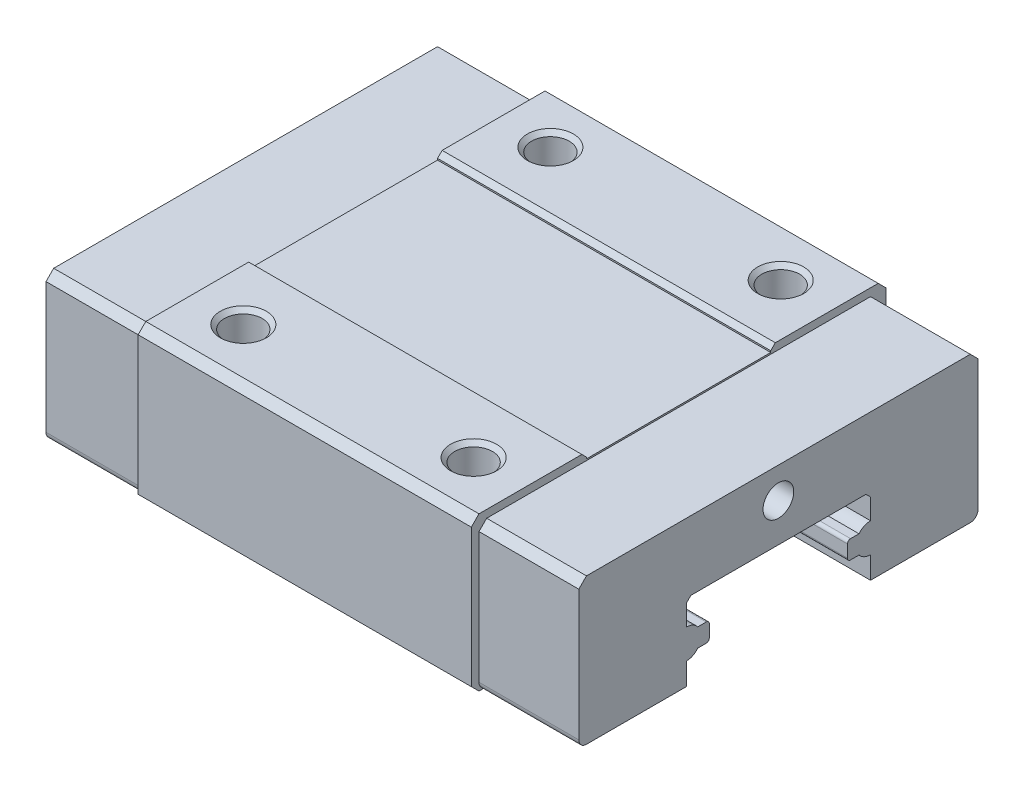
ISO-10303-21;
HEADER;
FILE_DESCRIPTION(('STEP AP214'),'2;1');
FILE_NAME('part.step','',(''),(''),'','','');
FILE_SCHEMA(('AUTOMOTIVE_DESIGN { 1 0 10303 214 1 1 1 1 }'));
ENDSEC;
DATA;
#1=APPLICATION_CONTEXT('core data for automotive mechanical design processes');
#2=APPLICATION_PROTOCOL_DEFINITION('international standard','automotive_design',2000,#1);
#3=PRODUCT_CONTEXT('',#1,'mechanical');
#4=PRODUCT('Part','Part','',(#3));
#5=PRODUCT_RELATED_PRODUCT_CATEGORY('part','',(#4));
#6=PRODUCT_DEFINITION_FORMATION('','',#4);
#7=PRODUCT_DEFINITION_CONTEXT('part definition',#1,'design');
#8=PRODUCT_DEFINITION('design','',#6,#7);
#9=PRODUCT_DEFINITION_SHAPE('','',#8);
#10=(LENGTH_UNIT() NAMED_UNIT(*) SI_UNIT(.MILLI.,.METRE.));
#11=(NAMED_UNIT(*) PLANE_ANGLE_UNIT() SI_UNIT($,.RADIAN.));
#12=(NAMED_UNIT(*) SI_UNIT($,.STERADIAN.) SOLID_ANGLE_UNIT());
#13=UNCERTAINTY_MEASURE_WITH_UNIT(LENGTH_MEASURE(1.E-05),#10,'distance_accuracy_value','');
#14=(GEOMETRIC_REPRESENTATION_CONTEXT(3) GLOBAL_UNCERTAINTY_ASSIGNED_CONTEXT((#13)) GLOBAL_UNIT_ASSIGNED_CONTEXT((#10,
#11,#12)) REPRESENTATION_CONTEXT('',''));
#15=CARTESIAN_POINT('',(0.,0.,0.));
#16=DIRECTION('',(0.,0.,1.));
#17=DIRECTION('',(1.,0.,0.));
#18=AXIS2_PLACEMENT_3D('',#15,#16,#17);
#19=CARTESIAN_POINT('',(9.85,10.,10.));
#20=DIRECTION('',(0.,1.,0.));
#21=DIRECTION('',(0.,0.,1.));
#22=AXIS2_PLACEMENT_3D('',#19,#20,#21);
#23=CONICAL_SURFACE('',#22,1.5,0.7853981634);
#24=CARTESIAN_POINT('',(9.85,10.,10.));
#25=DIRECTION('',(0.,-1.,0.));
#26=DIRECTION('',(0.,0.,-1.));
#27=AXIS2_PLACEMENT_3D('',#24,#25,#26);
#28=CIRCLE('',#27,1.5);
#29=CARTESIAN_POINT('',(9.85,10.,8.5));
#30=VERTEX_POINT('',#29);
#31=EDGE_CURVE('E39',#30,#30,#28,.T.);
#32=ORIENTED_EDGE('',*,*,#31,.F.);
#33=EDGE_LOOP('',(#32));
#34=FACE_BOUND('',#33,.T.);
#35=CARTESIAN_POINT('',(9.85,9.7295,10.));
#36=DIRECTION('',(0.,-1.,0.));
#37=DIRECTION('',(0.,0.,-1.));
#38=AXIS2_PLACEMENT_3D('',#35,#36,#37);
#39=CIRCLE('',#38,1.2295);
#40=CARTESIAN_POINT('',(9.85,9.7295,8.7705));
#41=VERTEX_POINT('',#40);
#42=EDGE_CURVE('E10',#41,#41,#39,.T.);
#43=ORIENTED_EDGE('',*,*,#42,.T.);
#44=EDGE_LOOP('',(#43));
#45=FACE_BOUND('',#44,.T.);
#46=ADVANCED_FACE('F16',(#34,#45),#23,.F.);
#47=CARTESIAN_POINT('',(9.85,6.5,10.));
#48=DIRECTION('',(0.,1.,0.));
#49=DIRECTION('',(0.,0.,-1.));
#50=AXIS2_PLACEMENT_3D('',#47,#48,#49);
#51=CYLINDRICAL_SURFACE('',#50,1.2295);
#52=ORIENTED_EDGE('',*,*,#42,.F.);
#53=EDGE_LOOP('',(#52));
#54=FACE_BOUND('',#53,.T.);
#55=CARTESIAN_POINT('',(9.85,6.5,10.));
#56=DIRECTION('',(0.,-1.,0.));
#57=DIRECTION('',(0.,0.,-1.));
#58=AXIS2_PLACEMENT_3D('',#55,#56,#57);
#59=CIRCLE('',#58,1.2295);
#60=CARTESIAN_POINT('',(9.85,6.5,8.7705));
#61=VERTEX_POINT('',#60);
#62=EDGE_CURVE('E27',#61,#61,#59,.T.);
#63=ORIENTED_EDGE('',*,*,#62,.T.);
#64=EDGE_LOOP('',(#63));
#65=FACE_BOUND('',#64,.T.);
#66=ADVANCED_FACE('F1346',(#54,#65),#51,.F.);
#67=CARTESIAN_POINT('',(62.9,9.,13.));
#68=DIRECTION('',(0.,0.,-1.));
#69=DIRECTION('',(0.,-1.,0.));
#70=AXIS2_PLACEMENT_3D('',#67,#68,#69);
#71=PLANE('',#70);
#72=DIRECTION('',(0.,1.,0.));
#73=VECTOR('',#72,1.);
#74=CARTESIAN_POINT('',(34.7,2.4,13.));
#75=LINE('',#74,#73);
#76=CARTESIAN_POINT('',(34.7,0.5,13.));
#77=VERTEX_POINT('',#76);
#78=CARTESIAN_POINT('',(34.7,9.,13.));
#79=VERTEX_POINT('',#78);
#80=EDGE_CURVE('E460',#77,#79,#75,.T.);
#81=ORIENTED_EDGE('',*,*,#80,.T.);
#82=DIRECTION('',(-1.,0.,0.));
#83=VECTOR('',#82,1.);
#84=CARTESIAN_POINT('',(62.9,9.,13.));
#85=LINE('',#84,#83);
#86=CARTESIAN_POINT('',(28.2,9.,13.));
#87=VERTEX_POINT('',#86);
#88=EDGE_CURVE('E467',#79,#87,#85,.T.);
#89=ORIENTED_EDGE('',*,*,#88,.T.);
#90=DIRECTION('',(0.,-1.,0.));
#91=VECTOR('',#90,1.);
#92=CARTESIAN_POINT('',(28.2,9.,13.));
#93=LINE('',#92,#91);
#94=CARTESIAN_POINT('',(28.2,0.5,13.));
#95=VERTEX_POINT('',#94);
#96=EDGE_CURVE('E533',#87,#95,#93,.T.);
#97=ORIENTED_EDGE('',*,*,#96,.T.);
#98=DIRECTION('',(-1.,0.,0.));
#99=VECTOR('',#98,1.);
#100=CARTESIAN_POINT('',(62.9,0.5,13.));
#101=LINE('',#100,#99);
#102=EDGE_CURVE('E1178',#77,#95,#101,.T.);
#103=ORIENTED_EDGE('',*,*,#102,.F.);
#104=EDGE_LOOP('',(#81,#89,#97,#103));
#105=FACE_BOUND('',#104,.T.);
#106=ADVANCED_FACE('F1352',(#105),#71,.F.);
#107=CARTESIAN_POINT('',(34.7,10.,-13.));
#108=DIRECTION('',(0.,-1.,0.));
#109=DIRECTION('',(0.,0.,-1.));
#110=AXIS2_PLACEMENT_3D('',#107,#108,#109);
#111=PLANE('',#110);
#112=DIRECTION('',(-1.,0.,0.));
#113=VECTOR('',#112,1.);
#114=CARTESIAN_POINT('',(34.7,10.,6.3));
#115=LINE('',#114,#113);
#116=CARTESIAN_POINT('',(28.2,10.,6.3));
#117=VERTEX_POINT('',#116);
#118=CARTESIAN_POINT('',(6.5,10.,6.3));
#119=VERTEX_POINT('',#118);
#120=EDGE_CURVE('E529',#117,#119,#115,.T.);
#121=ORIENTED_EDGE('',*,*,#120,.T.);
#122=DIRECTION('',(0.,0.,1.));
#123=VECTOR('',#122,1.);
#124=CARTESIAN_POINT('',(6.5,10.,-13.5));
#125=LINE('',#124,#123);
#126=CARTESIAN_POINT('',(6.5,10.,13.));
#127=VERTEX_POINT('',#126);
#128=EDGE_CURVE('E534',#119,#127,#125,.T.);
#129=ORIENTED_EDGE('',*,*,#128,.T.);
#130=DIRECTION('',(-1.,0.,0.));
#131=VECTOR('',#130,1.);
#132=CARTESIAN_POINT('',(34.7,10.,13.));
#133=LINE('',#132,#131);
#134=CARTESIAN_POINT('',(28.2,10.,13.));
#135=VERTEX_POINT('',#134);
#136=EDGE_CURVE('E580',#135,#127,#133,.T.);
#137=ORIENTED_EDGE('',*,*,#136,.F.);
#138=DIRECTION('',(0.,0.,1.));
#139=VECTOR('',#138,1.);
#140=CARTESIAN_POINT('',(28.2,10.,-13.5));
#141=LINE('',#140,#139);
#142=EDGE_CURVE('E686',#117,#135,#141,.T.);
#143=ORIENTED_EDGE('',*,*,#142,.F.);
#144=EDGE_LOOP('',(#121,#129,#137,#143));
#145=FACE_BOUND('',#144,.T.);
#146=ORIENTED_EDGE('',*,*,#31,.T.);
#147=EDGE_LOOP('',(#146));
#148=FACE_BOUND('',#147,.T.);
#149=CARTESIAN_POINT('',(24.85,10.,10.));
#150=DIRECTION('',(0.,-1.,0.));
#151=DIRECTION('',(0.,0.,-1.));
#152=AXIS2_PLACEMENT_3D('',#149,#150,#151);
#153=CIRCLE('',#152,1.5);
#154=CARTESIAN_POINT('',(24.85,10.,8.5));
#155=VERTEX_POINT('',#154);
#156=EDGE_CURVE('E639',#155,#155,#153,.T.);
#157=ORIENTED_EDGE('',*,*,#156,.T.);
#158=EDGE_LOOP('',(#157));
#159=FACE_BOUND('',#158,.T.);
#160=ADVANCED_FACE('F1229',(#145,#148,#159),#111,.F.);
#161=CARTESIAN_POINT('',(34.7,10.,-13.));
#162=DIRECTION('',(0.,-1.,0.));
#163=DIRECTION('',(0.,0.,-1.));
#164=AXIS2_PLACEMENT_3D('',#161,#162,#163);
#165=PLANE('',#164);
#166=DIRECTION('',(-1.,0.,0.));
#167=VECTOR('',#166,1.);
#168=CARTESIAN_POINT('',(34.7,10.,-6.3));
#169=LINE('',#168,#167);
#170=CARTESIAN_POINT('',(28.2,10.,-6.3));
#171=VERTEX_POINT('',#170);
#172=CARTESIAN_POINT('',(6.5,10.,-6.3));
#173=VERTEX_POINT('',#172);
#174=EDGE_CURVE('E574',#171,#173,#169,.T.);
#175=ORIENTED_EDGE('',*,*,#174,.F.);
#176=DIRECTION('',(0.,0.,1.));
#177=VECTOR('',#176,1.);
#178=CARTESIAN_POINT('',(28.2,10.,-13.5));
#179=LINE('',#178,#177);
#180=CARTESIAN_POINT('',(28.2,10.,-13.));
#181=VERTEX_POINT('',#180);
#182=EDGE_CURVE('E728',#181,#171,#179,.T.);
#183=ORIENTED_EDGE('',*,*,#182,.F.);
#184=DIRECTION('',(-1.,0.,0.));
#185=VECTOR('',#184,1.);
#186=CARTESIAN_POINT('',(34.7,10.,-13.));
#187=LINE('',#186,#185);
#188=CARTESIAN_POINT('',(6.5,10.,-13.));
#189=VERTEX_POINT('',#188);
#190=EDGE_CURVE('E510',#181,#189,#187,.T.);
#191=ORIENTED_EDGE('',*,*,#190,.T.);
#192=DIRECTION('',(0.,0.,1.));
#193=VECTOR('',#192,1.);
#194=CARTESIAN_POINT('',(6.5,10.,-13.5));
#195=LINE('',#194,#193);
#196=EDGE_CURVE('E506',#189,#173,#195,.T.);
#197=ORIENTED_EDGE('',*,*,#196,.T.);
#198=EDGE_LOOP('',(#175,#183,#191,#197));
#199=FACE_BOUND('',#198,.T.);
#200=CARTESIAN_POINT('',(9.85,10.,-10.));
#201=DIRECTION('',(0.,-1.,0.));
#202=DIRECTION('',(0.,0.,-1.));
#203=AXIS2_PLACEMENT_3D('',#200,#201,#202);
#204=CIRCLE('',#203,1.5);
#205=CARTESIAN_POINT('',(9.85,10.,-11.5));
#206=VERTEX_POINT('',#205);
#207=EDGE_CURVE('E511',#206,#206,#204,.T.);
#208=ORIENTED_EDGE('',*,*,#207,.T.);
#209=EDGE_LOOP('',(#208));
#210=FACE_BOUND('',#209,.T.);
#211=CARTESIAN_POINT('',(24.85,10.,-10.));
#212=DIRECTION('',(0.,-1.,0.));
#213=DIRECTION('',(0.,0.,-1.));
#214=AXIS2_PLACEMENT_3D('',#211,#212,#213);
#215=CIRCLE('',#214,1.5);
#216=CARTESIAN_POINT('',(24.85,10.,-11.5));
#217=VERTEX_POINT('',#216);
#218=EDGE_CURVE('E734',#217,#217,#215,.T.);
#219=ORIENTED_EDGE('',*,*,#218,.T.);
#220=EDGE_LOOP('',(#219));
#221=FACE_BOUND('',#220,.T.);
#222=ADVANCED_FACE('F998',(#199,#210,#221),#165,.F.);
#223=CARTESIAN_POINT('',(34.7,9.5,-13.5));
#224=DIRECTION('',(0.,-0.707106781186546,0.707106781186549));
#225=DIRECTION('',(-1.,0.,0.));
#226=AXIS2_PLACEMENT_3D('',#223,#224,#225);
#227=PLANE('',#226);
#228=DIRECTION('',(0.,0.707106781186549,0.707106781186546));
#229=VECTOR('',#228,1.);
#230=CARTESIAN_POINT('',(28.2,9.5,-13.5));
#231=LINE('',#230,#229);
#232=CARTESIAN_POINT('',(28.2,9.5,-13.5));
#233=VERTEX_POINT('',#232);
#234=EDGE_CURVE('E692',#233,#181,#231,.T.);
#235=ORIENTED_EDGE('',*,*,#234,.F.);
#236=DIRECTION('',(-1.,0.,0.));
#237=VECTOR('',#236,1.);
#238=CARTESIAN_POINT('',(34.7,9.5,-13.5));
#239=LINE('',#238,#237);
#240=CARTESIAN_POINT('',(6.5,9.5,-13.5));
#241=VERTEX_POINT('',#240);
#242=EDGE_CURVE('E539',#233,#241,#239,.T.);
#243=ORIENTED_EDGE('',*,*,#242,.T.);
#244=DIRECTION('',(0.,0.707106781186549,0.707106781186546));
#245=VECTOR('',#244,1.);
#246=CARTESIAN_POINT('',(6.5,9.5,-13.5));
#247=LINE('',#246,#245);
#248=EDGE_CURVE('E535',#241,#189,#247,.T.);
#249=ORIENTED_EDGE('',*,*,#248,.T.);
#250=ORIENTED_EDGE('',*,*,#190,.F.);
#251=EDGE_LOOP('',(#235,#243,#249,#250));
#252=FACE_BOUND('',#251,.T.);
#253=ADVANCED_FACE('F1260',(#252),#227,.F.);
#254=CARTESIAN_POINT('',(34.7,0.5,-13.5));
#255=DIRECTION('',(0.,0.,1.));
#256=DIRECTION('',(1.,0.,0.));
#257=AXIS2_PLACEMENT_3D('',#254,#255,#256);
#258=PLANE('',#257);
#259=DIRECTION('',(0.,1.,0.));
#260=VECTOR('',#259,1.);
#261=CARTESIAN_POINT('',(28.2,-1.,-13.5));
#262=LINE('',#261,#260);
#263=CARTESIAN_POINT('',(28.2,0.5,-13.5));
#264=VERTEX_POINT('',#263);
#265=EDGE_CURVE('E687',#264,#233,#262,.T.);
#266=ORIENTED_EDGE('',*,*,#265,.F.);
#267=DIRECTION('',(-1.,0.,0.));
#268=VECTOR('',#267,1.);
#269=CARTESIAN_POINT('',(34.7,0.5,-13.5));
#270=LINE('',#269,#268);
#271=CARTESIAN_POINT('',(6.5,0.5,-13.5));
#272=VERTEX_POINT('',#271);
#273=EDGE_CURVE('E540',#264,#272,#270,.T.);
#274=ORIENTED_EDGE('',*,*,#273,.T.);
#275=DIRECTION('',(0.,1.,0.));
#276=VECTOR('',#275,1.);
#277=CARTESIAN_POINT('',(6.5,-1.,-13.5));
#278=LINE('',#277,#276);
#279=EDGE_CURVE('E934',#272,#241,#278,.T.);
#280=ORIENTED_EDGE('',*,*,#279,.T.);
#281=ORIENTED_EDGE('',*,*,#242,.F.);
#282=EDGE_LOOP('',(#266,#274,#280,#281));
#283=FACE_BOUND('',#282,.T.);
#284=ADVANCED_FACE('F1262',(#283),#258,.F.);
#285=CARTESIAN_POINT('',(34.7,0.,-13.));
#286=DIRECTION('',(0.,0.707106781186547,0.707106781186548));
#287=DIRECTION('',(1.,0.,0.));
#288=AXIS2_PLACEMENT_3D('',#285,#286,#287);
#289=PLANE('',#288);
#290=DIRECTION('',(0.,0.707106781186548,-0.707106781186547));
#291=VECTOR('',#290,1.);
#292=CARTESIAN_POINT('',(28.2,0.,-13.));
#293=LINE('',#292,#291);
#294=CARTESIAN_POINT('',(28.2,0.,-13.));
#295=VERTEX_POINT('',#294);
#296=EDGE_CURVE('E691',#295,#264,#293,.T.);
#297=ORIENTED_EDGE('',*,*,#296,.F.);
#298=DIRECTION('',(-1.,0.,0.));
#299=VECTOR('',#298,1.);
#300=CARTESIAN_POINT('',(34.7,0.,-13.));
#301=LINE('',#300,#299);
#302=CARTESIAN_POINT('',(6.5,0.,-13.));
#303=VERTEX_POINT('',#302);
#304=EDGE_CURVE('E889',#295,#303,#301,.T.);
#305=ORIENTED_EDGE('',*,*,#304,.T.);
#306=DIRECTION('',(0.,0.707106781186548,-0.707106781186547));
#307=VECTOR('',#306,1.);
#308=CARTESIAN_POINT('',(6.5,0.,-13.));
#309=LINE('',#308,#307);
#310=EDGE_CURVE('E705',#303,#272,#309,.T.);
#311=ORIENTED_EDGE('',*,*,#310,.T.);
#312=ORIENTED_EDGE('',*,*,#273,.F.);
#313=EDGE_LOOP('',(#297,#305,#311,#312));
#314=FACE_BOUND('',#313,.T.);
#315=ADVANCED_FACE('F1265',(#314),#289,.F.);
#316=CARTESIAN_POINT('',(34.7,0.,-6.));
#317=DIRECTION('',(0.,1.,0.));
#318=DIRECTION('',(1.,0.,0.));
#319=AXIS2_PLACEMENT_3D('',#316,#317,#318);
#320=PLANE('',#319);
#321=DIRECTION('',(-1.,0.,0.));
#322=VECTOR('',#321,1.);
#323=CARTESIAN_POINT('',(34.7,0.,-6.));
#324=LINE('',#323,#322);
#325=CARTESIAN_POINT('',(34.7,0.,-6.));
#326=VERTEX_POINT('',#325);
#327=CARTESIAN_POINT('',(0.,0.,-6.));
#328=VERTEX_POINT('',#327);
#329=EDGE_CURVE('E599',#326,#328,#324,.T.);
#330=ORIENTED_EDGE('',*,*,#329,.T.);
#331=DIRECTION('',(0.,0.,-1.));
#332=VECTOR('',#331,1.);
#333=CARTESIAN_POINT('',(0.,0.,-6.));
#334=LINE('',#333,#332);
#335=CARTESIAN_POINT('',(0.,0.,-12.5));
#336=VERTEX_POINT('',#335);
#337=EDGE_CURVE('E595',#328,#336,#334,.T.);
#338=ORIENTED_EDGE('',*,*,#337,.T.);
#339=DIRECTION('',(1.,0.,0.));
#340=VECTOR('',#339,1.);
#341=CARTESIAN_POINT('',(-28.2,0.,-12.5));
#342=LINE('',#341,#340);
#343=CARTESIAN_POINT('',(6.5,0.,-12.5));
#344=VERTEX_POINT('',#343);
#345=EDGE_CURVE('E600',#336,#344,#342,.T.);
#346=ORIENTED_EDGE('',*,*,#345,.T.);
#347=DIRECTION('',(0.,0.,-1.));
#348=VECTOR('',#347,1.);
#349=CARTESIAN_POINT('',(6.5,0.,-6.));
#350=LINE('',#349,#348);
#351=EDGE_CURVE('E967',#344,#303,#350,.T.);
#352=ORIENTED_EDGE('',*,*,#351,.T.);
#353=ORIENTED_EDGE('',*,*,#304,.F.);
#354=DIRECTION('',(0.,0.,-1.));
#355=VECTOR('',#354,1.);
#356=CARTESIAN_POINT('',(28.2,0.,-6.));
#357=LINE('',#356,#355);
#358=CARTESIAN_POINT('',(28.2,0.,-12.5));
#359=VERTEX_POINT('',#358);
#360=EDGE_CURVE('E813',#359,#295,#357,.T.);
#361=ORIENTED_EDGE('',*,*,#360,.F.);
#362=DIRECTION('',(-1.,0.,0.));
#363=VECTOR('',#362,1.);
#364=CARTESIAN_POINT('',(62.9,0.,-12.5));
#365=LINE('',#364,#363);
#366=CARTESIAN_POINT('',(34.7,0.,-12.5));
#367=VERTEX_POINT('',#366);
#368=EDGE_CURVE('E796',#367,#359,#365,.T.);
#369=ORIENTED_EDGE('',*,*,#368,.F.);
#370=DIRECTION('',(0.,0.,-1.));
#371=VECTOR('',#370,1.);
#372=CARTESIAN_POINT('',(34.7,0.,-6.));
#373=LINE('',#372,#371);
#374=EDGE_CURVE('E954',#326,#367,#373,.T.);
#375=ORIENTED_EDGE('',*,*,#374,.F.);
#376=EDGE_LOOP('',(#330,#338,#346,#352,#353,#361,#369,#375));
#377=FACE_BOUND('',#376,.T.);
#378=ADVANCED_FACE('F1269',(#377),#320,.F.);
#379=CARTESIAN_POINT('',(34.7,1.43953136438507,-6.));
#380=DIRECTION('',(0.,0.,-1.));
#381=DIRECTION('',(0.,-1.,0.));
#382=AXIS2_PLACEMENT_3D('',#379,#380,#381);
#383=PLANE('',#382);
#384=DIRECTION('',(0.,-1.,0.));
#385=VECTOR('',#384,1.);
#386=CARTESIAN_POINT('',(0.,1.43953136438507,-6.));
#387=LINE('',#386,#385);
#388=CARTESIAN_POINT('',(0.,1.43953136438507,-6.));
#389=VERTEX_POINT('',#388);
#390=EDGE_CURVE('E1038',#389,#328,#387,.T.);
#391=ORIENTED_EDGE('',*,*,#390,.T.);
#392=ORIENTED_EDGE('',*,*,#329,.F.);
#393=DIRECTION('',(0.,-1.,0.));
#394=VECTOR('',#393,1.);
#395=CARTESIAN_POINT('',(34.7,1.43953136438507,-6.));
#396=LINE('',#395,#394);
#397=CARTESIAN_POINT('',(34.7,1.43953136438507,-6.));
#398=VERTEX_POINT('',#397);
#399=EDGE_CURVE('E782',#398,#326,#396,.T.);
#400=ORIENTED_EDGE('',*,*,#399,.F.);
#401=DIRECTION('',(-1.,0.,0.));
#402=VECTOR('',#401,1.);
#403=CARTESIAN_POINT('',(34.7,1.43953136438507,-6.));
#404=LINE('',#403,#402);
#405=EDGE_CURVE('E951',#398,#389,#404,.T.);
#406=ORIENTED_EDGE('',*,*,#405,.T.);
#407=EDGE_LOOP('',(#391,#392,#400,#406));
#408=FACE_BOUND('',#407,.T.);
#409=ADVANCED_FACE('F1087',(#408),#383,.F.);
#410=CARTESIAN_POINT('',(34.7,2.4,-6.));
#411=DIRECTION('',(1.,0.,0.));
#412=DIRECTION('',(0.,0.,1.));
#413=AXIS2_PLACEMENT_3D('',#410,#411,#412);
#414=CYLINDRICAL_SURFACE('',#413,0.9604686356);
#415=CARTESIAN_POINT('',(0.,2.4,-6.));
#416=DIRECTION('',(1.,0.,0.));
#417=DIRECTION('',(0.,0.,-1.));
#418=AXIS2_PLACEMENT_3D('',#415,#416,#417);
#419=CIRCLE('',#418,0.9604686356);
#420=CARTESIAN_POINT('',(0.,1.8,-5.25));
#421=VERTEX_POINT('',#420);
#422=EDGE_CURVE('E862',#421,#389,#419,.T.);
#423=ORIENTED_EDGE('',*,*,#422,.T.);
#424=ORIENTED_EDGE('',*,*,#405,.F.);
#425=CARTESIAN_POINT('',(34.7,2.4,-6.));
#426=DIRECTION('',(1.,0.,0.));
#427=DIRECTION('',(0.,0.,-1.));
#428=AXIS2_PLACEMENT_3D('',#425,#426,#427);
#429=CIRCLE('',#428,0.9604686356);
#430=CARTESIAN_POINT('',(34.7,1.8,-5.25));
#431=VERTEX_POINT('',#430);
#432=EDGE_CURVE('E723',#431,#398,#429,.T.);
#433=ORIENTED_EDGE('',*,*,#432,.F.);
#434=DIRECTION('',(-1.,0.,0.));
#435=VECTOR('',#434,1.);
#436=CARTESIAN_POINT('',(34.7,1.8,-5.25));
#437=LINE('',#436,#435);
#438=EDGE_CURVE('E859',#431,#421,#437,.T.);
#439=ORIENTED_EDGE('',*,*,#438,.T.);
#440=EDGE_LOOP('',(#423,#424,#433,#439));
#441=FACE_BOUND('',#440,.T.);
#442=ADVANCED_FACE('F1090',(#441),#414,.T.);
#443=CARTESIAN_POINT('',(34.7,1.8,-4.7));
#444=DIRECTION('',(0.,1.,0.));
#445=DIRECTION('',(1.,0.,0.));
#446=AXIS2_PLACEMENT_3D('',#443,#444,#445);
#447=PLANE('',#446);
#448=DIRECTION('',(0.,0.,-1.));
#449=VECTOR('',#448,1.);
#450=CARTESIAN_POINT('',(0.,1.8,-4.7));
#451=LINE('',#450,#449);
#452=CARTESIAN_POINT('',(0.,1.8,-4.7));
#453=VERTEX_POINT('',#452);
#454=EDGE_CURVE('E857',#453,#421,#451,.T.);
#455=ORIENTED_EDGE('',*,*,#454,.T.);
#456=ORIENTED_EDGE('',*,*,#438,.F.);
#457=DIRECTION('',(0.,0.,-1.));
#458=VECTOR('',#457,1.);
#459=CARTESIAN_POINT('',(34.7,1.8,-4.7));
#460=LINE('',#459,#458);
#461=CARTESIAN_POINT('',(34.7,1.8,-4.7));
#462=VERTEX_POINT('',#461);
#463=EDGE_CURVE('E609',#462,#431,#460,.T.);
#464=ORIENTED_EDGE('',*,*,#463,.F.);
#465=DIRECTION('',(-1.,0.,0.));
#466=VECTOR('',#465,1.);
#467=CARTESIAN_POINT('',(34.7,1.8,-4.7));
#468=LINE('',#467,#466);
#469=EDGE_CURVE('E673',#462,#453,#468,.T.);
#470=ORIENTED_EDGE('',*,*,#469,.T.);
#471=EDGE_LOOP('',(#455,#456,#464,#470));
#472=FACE_BOUND('',#471,.T.);
#473=ADVANCED_FACE('F1101',(#472),#447,.F.);
#474=CARTESIAN_POINT('',(34.7,2.,-4.7));
#475=DIRECTION('',(1.,0.,0.));
#476=DIRECTION('',(0.,0.,1.));
#477=AXIS2_PLACEMENT_3D('',#474,#475,#476);
#478=CYLINDRICAL_SURFACE('',#477,0.2);
#479=CARTESIAN_POINT('',(0.,2.,-4.7));
#480=DIRECTION('',(1.,0.,0.));
#481=DIRECTION('',(0.,0.,-1.));
#482=AXIS2_PLACEMENT_3D('',#479,#480,#481);
#483=CIRCLE('',#482,0.2);
#484=CARTESIAN_POINT('',(0.,2.,-4.5));
#485=VERTEX_POINT('',#484);
#486=EDGE_CURVE('E527',#485,#453,#483,.T.);
#487=ORIENTED_EDGE('',*,*,#486,.T.);
#488=ORIENTED_EDGE('',*,*,#469,.F.);
#489=CARTESIAN_POINT('',(34.7,2.,-4.7));
#490=DIRECTION('',(1.,0.,0.));
#491=DIRECTION('',(0.,0.,-1.));
#492=AXIS2_PLACEMENT_3D('',#489,#490,#491);
#493=CIRCLE('',#492,0.2);
#494=CARTESIAN_POINT('',(34.7,2.,-4.5));
#495=VERTEX_POINT('',#494);
#496=EDGE_CURVE('E604',#495,#462,#493,.T.);
#497=ORIENTED_EDGE('',*,*,#496,.F.);
#498=DIRECTION('',(-1.,0.,0.));
#499=VECTOR('',#498,1.);
#500=CARTESIAN_POINT('',(34.7,2.,-4.5));
#501=LINE('',#500,#499);
#502=EDGE_CURVE('E524',#495,#485,#501,.T.);
#503=ORIENTED_EDGE('',*,*,#502,.T.);
#504=EDGE_LOOP('',(#487,#488,#497,#503));
#505=FACE_BOUND('',#504,.T.);
#506=ADVANCED_FACE('F1108',(#505),#478,.T.);
#507=CARTESIAN_POINT('',(34.7,2.8,-4.5));
#508=DIRECTION('',(0.,0.,-1.));
#509=DIRECTION('',(0.,-1.,0.));
#510=AXIS2_PLACEMENT_3D('',#507,#508,#509);
#511=PLANE('',#510);
#512=DIRECTION('',(0.,-1.,0.));
#513=VECTOR('',#512,1.);
#514=CARTESIAN_POINT('',(0.,2.8,-4.5));
#515=LINE('',#514,#513);
#516=CARTESIAN_POINT('',(0.,2.8,-4.5));
#517=VERTEX_POINT('',#516);
#518=EDGE_CURVE('E528',#517,#485,#515,.T.);
#519=ORIENTED_EDGE('',*,*,#518,.T.);
#520=ORIENTED_EDGE('',*,*,#502,.F.);
#521=DIRECTION('',(0.,-1.,0.));
#522=VECTOR('',#521,1.);
#523=CARTESIAN_POINT('',(34.7,2.8,-4.5));
#524=LINE('',#523,#522);
#525=CARTESIAN_POINT('',(34.7,2.8,-4.5));
#526=VERTEX_POINT('',#525);
#527=EDGE_CURVE('E608',#526,#495,#524,.T.);
#528=ORIENTED_EDGE('',*,*,#527,.F.);
#529=DIRECTION('',(-1.,0.,0.));
#530=VECTOR('',#529,1.);
#531=CARTESIAN_POINT('',(34.7,2.8,-4.5));
#532=LINE('',#531,#530);
#533=EDGE_CURVE('E651',#526,#517,#532,.T.);
#534=ORIENTED_EDGE('',*,*,#533,.T.);
#535=EDGE_LOOP('',(#519,#520,#528,#534));
#536=FACE_BOUND('',#535,.T.);
#537=ADVANCED_FACE('F1114',(#536),#511,.F.);
#538=CARTESIAN_POINT('',(34.7,2.8,-4.7));
#539=DIRECTION('',(1.,0.,0.));
#540=DIRECTION('',(0.,0.,1.));
#541=AXIS2_PLACEMENT_3D('',#538,#539,#540);
#542=CYLINDRICAL_SURFACE('',#541,0.2);
#543=CARTESIAN_POINT('',(0.,2.8,-4.7));
#544=DIRECTION('',(1.,0.,0.));
#545=DIRECTION('',(0.,0.,-1.));
#546=AXIS2_PLACEMENT_3D('',#543,#544,#545);
#547=CIRCLE('',#546,0.2);
#548=CARTESIAN_POINT('',(0.,3.,-4.7));
#549=VERTEX_POINT('',#548);
#550=EDGE_CURVE('E544',#549,#517,#547,.T.);
#551=ORIENTED_EDGE('',*,*,#550,.T.);
#552=ORIENTED_EDGE('',*,*,#533,.F.);
#553=CARTESIAN_POINT('',(34.7,2.8,-4.7));
#554=DIRECTION('',(1.,0.,0.));
#555=DIRECTION('',(0.,0.,-1.));
#556=AXIS2_PLACEMENT_3D('',#553,#554,#555);
#557=CIRCLE('',#556,0.2);
#558=CARTESIAN_POINT('',(34.7,3.,-4.7));
#559=VERTEX_POINT('',#558);
#560=EDGE_CURVE('E849',#559,#526,#557,.T.);
#561=ORIENTED_EDGE('',*,*,#560,.F.);
#562=DIRECTION('',(-1.,0.,0.));
#563=VECTOR('',#562,1.);
#564=CARTESIAN_POINT('',(34.7,3.,-4.7));
#565=LINE('',#564,#563);
#566=EDGE_CURVE('E541',#559,#549,#565,.T.);
#567=ORIENTED_EDGE('',*,*,#566,.T.);
#568=EDGE_LOOP('',(#551,#552,#561,#567));
#569=FACE_BOUND('',#568,.T.);
#570=ADVANCED_FACE('F1117',(#569),#542,.T.);
#571=CARTESIAN_POINT('',(34.7,3.,-5.25));
#572=DIRECTION('',(0.,-1.,0.));
#573=DIRECTION('',(0.,0.,-1.));
#574=AXIS2_PLACEMENT_3D('',#571,#572,#573);
#575=PLANE('',#574);
#576=DIRECTION('',(0.,0.,1.));
#577=VECTOR('',#576,1.);
#578=CARTESIAN_POINT('',(0.,3.,-5.25));
#579=LINE('',#578,#577);
#580=CARTESIAN_POINT('',(0.,3.,-5.25));
#581=VERTEX_POINT('',#580);
#582=EDGE_CURVE('E545',#581,#549,#579,.T.);
#583=ORIENTED_EDGE('',*,*,#582,.T.);
#584=ORIENTED_EDGE('',*,*,#566,.F.);
#585=DIRECTION('',(0.,0.,1.));
#586=VECTOR('',#585,1.);
#587=CARTESIAN_POINT('',(34.7,3.,-5.25));
#588=LINE('',#587,#586);
#589=CARTESIAN_POINT('',(34.7,3.,-5.25));
#590=VERTEX_POINT('',#589);
#591=EDGE_CURVE('E875',#590,#559,#588,.T.);
#592=ORIENTED_EDGE('',*,*,#591,.F.);
#593=DIRECTION('',(-1.,0.,0.));
#594=VECTOR('',#593,1.);
#595=CARTESIAN_POINT('',(34.7,3.,-5.25));
#596=LINE('',#595,#594);
#597=EDGE_CURVE('E809',#590,#581,#596,.T.);
#598=ORIENTED_EDGE('',*,*,#597,.T.);
#599=EDGE_LOOP('',(#583,#584,#592,#598));
#600=FACE_BOUND('',#599,.T.);
#601=ADVANCED_FACE('F1126',(#600),#575,.F.);
#602=CARTESIAN_POINT('',(34.7,2.4,-6.));
#603=DIRECTION('',(1.,0.,0.));
#604=DIRECTION('',(0.,0.,1.));
#605=AXIS2_PLACEMENT_3D('',#602,#603,#604);
#606=CYLINDRICAL_SURFACE('',#605,0.9604686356);
#607=CARTESIAN_POINT('',(0.,2.4,-6.));
#608=DIRECTION('',(1.,0.,0.));
#609=DIRECTION('',(0.,0.,-1.));
#610=AXIS2_PLACEMENT_3D('',#607,#608,#609);
#611=CIRCLE('',#610,0.9604686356);
#612=CARTESIAN_POINT('',(0.,3.36046863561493,-6.));
#613=VERTEX_POINT('',#612);
#614=EDGE_CURVE('E963',#613,#581,#611,.T.);
#615=ORIENTED_EDGE('',*,*,#614,.T.);
#616=ORIENTED_EDGE('',*,*,#597,.F.);
#617=CARTESIAN_POINT('',(34.7,2.4,-6.));
#618=DIRECTION('',(1.,0.,0.));
#619=DIRECTION('',(0.,0.,-1.));
#620=AXIS2_PLACEMENT_3D('',#617,#618,#619);
#621=CIRCLE('',#620,0.9604686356);
#622=CARTESIAN_POINT('',(34.7,3.36046863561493,-6.));
#623=VERTEX_POINT('',#622);
#624=EDGE_CURVE('E494',#623,#590,#621,.T.);
#625=ORIENTED_EDGE('',*,*,#624,.F.);
#626=DIRECTION('',(-1.,0.,0.));
#627=VECTOR('',#626,1.);
#628=CARTESIAN_POINT('',(34.7,3.36046863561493,-6.));
#629=LINE('',#628,#627);
#630=EDGE_CURVE('E663',#623,#613,#629,.T.);
#631=ORIENTED_EDGE('',*,*,#630,.T.);
#632=EDGE_LOOP('',(#615,#616,#625,#631));
#633=FACE_BOUND('',#632,.T.);
#634=ADVANCED_FACE('F1129',(#633),#606,.T.);
#635=CARTESIAN_POINT('',(34.7,4.7,-6.));
#636=DIRECTION('',(0.,0.,-1.));
#637=DIRECTION('',(0.,-1.,0.));
#638=AXIS2_PLACEMENT_3D('',#635,#636,#637);
#639=PLANE('',#638);
#640=DIRECTION('',(0.,-1.,0.));
#641=VECTOR('',#640,1.);
#642=CARTESIAN_POINT('',(0.,4.7,-6.));
#643=LINE('',#642,#641);
#644=CARTESIAN_POINT('',(0.,4.7,-6.));
#645=VERTEX_POINT('',#644);
#646=EDGE_CURVE('E659',#645,#613,#643,.T.);
#647=ORIENTED_EDGE('',*,*,#646,.T.);
#648=ORIENTED_EDGE('',*,*,#630,.F.);
#649=DIRECTION('',(0.,-1.,0.));
#650=VECTOR('',#649,1.);
#651=CARTESIAN_POINT('',(34.7,4.7,-6.));
#652=LINE('',#651,#650);
#653=CARTESIAN_POINT('',(34.7,4.7,-6.));
#654=VERTEX_POINT('',#653);
#655=EDGE_CURVE('E489',#654,#623,#652,.T.);
#656=ORIENTED_EDGE('',*,*,#655,.F.);
#657=DIRECTION('',(-1.,0.,0.));
#658=VECTOR('',#657,1.);
#659=CARTESIAN_POINT('',(34.7,4.7,-6.));
#660=LINE('',#659,#658);
#661=EDGE_CURVE('E556',#654,#645,#660,.T.);
#662=ORIENTED_EDGE('',*,*,#661,.T.);
#663=EDGE_LOOP('',(#647,#648,#656,#662));
#664=FACE_BOUND('',#663,.T.);
#665=ADVANCED_FACE('F1133',(#664),#639,.F.);
#666=CARTESIAN_POINT('',(34.7,5.,-5.7));
#667=DIRECTION('',(0.,0.707106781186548,-0.707106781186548));
#668=DIRECTION('',(-1.,0.,0.));
#669=AXIS2_PLACEMENT_3D('',#666,#667,#668);
#670=PLANE('',#669);
#671=DIRECTION('',(0.,-0.707106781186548,-0.707106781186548));
#672=VECTOR('',#671,1.);
#673=CARTESIAN_POINT('',(0.,5.,-5.7));
#674=LINE('',#673,#672);
#675=CARTESIAN_POINT('',(0.,5.,-5.7));
#676=VERTEX_POINT('',#675);
#677=EDGE_CURVE('E552',#676,#645,#674,.T.);
#678=ORIENTED_EDGE('',*,*,#677,.T.);
#679=ORIENTED_EDGE('',*,*,#661,.F.);
#680=DIRECTION('',(0.,-0.707106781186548,-0.707106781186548));
#681=VECTOR('',#680,1.);
#682=CARTESIAN_POINT('',(34.7,5.,-5.7));
#683=LINE('',#682,#681);
#684=CARTESIAN_POINT('',(34.7,5.,-5.7));
#685=VERTEX_POINT('',#684);
#686=EDGE_CURVE('E493',#685,#654,#683,.T.);
#687=ORIENTED_EDGE('',*,*,#686,.F.);
#688=DIRECTION('',(-1.,0.,0.));
#689=VECTOR('',#688,1.);
#690=CARTESIAN_POINT('',(34.7,5.,-5.7));
#691=LINE('',#690,#689);
#692=EDGE_CURVE('E557',#685,#676,#691,.T.);
#693=ORIENTED_EDGE('',*,*,#692,.T.);
#694=EDGE_LOOP('',(#678,#679,#687,#693));
#695=FACE_BOUND('',#694,.T.);
#696=ADVANCED_FACE('F1136',(#695),#670,.F.);
#697=CARTESIAN_POINT('',(34.7,5.,5.7));
#698=DIRECTION('',(0.,1.,0.));
#699=DIRECTION('',(1.,0.,0.));
#700=AXIS2_PLACEMENT_3D('',#697,#698,#699);
#701=PLANE('',#700);
#702=DIRECTION('',(0.,0.,-1.));
#703=VECTOR('',#702,1.);
#704=CARTESIAN_POINT('',(0.,5.,5.7));
#705=LINE('',#704,#703);
#706=CARTESIAN_POINT('',(0.,5.,5.7));
#707=VERTEX_POINT('',#706);
#708=EDGE_CURVE('E1026',#707,#676,#705,.T.);
#709=ORIENTED_EDGE('',*,*,#708,.T.);
#710=ORIENTED_EDGE('',*,*,#692,.F.);
#711=DIRECTION('',(0.,0.,-1.));
#712=VECTOR('',#711,1.);
#713=CARTESIAN_POINT('',(34.7,5.,5.7));
#714=LINE('',#713,#712);
#715=CARTESIAN_POINT('',(34.7,5.,5.7));
#716=VERTEX_POINT('',#715);
#717=EDGE_CURVE('E866',#716,#685,#714,.T.);
#718=ORIENTED_EDGE('',*,*,#717,.F.);
#719=DIRECTION('',(-1.,0.,0.));
#720=VECTOR('',#719,1.);
#721=CARTESIAN_POINT('',(34.7,5.,5.7));
#722=LINE('',#721,#720);
#723=EDGE_CURVE('E522',#716,#707,#722,.T.);
#724=ORIENTED_EDGE('',*,*,#723,.T.);
#725=EDGE_LOOP('',(#709,#710,#718,#724));
#726=FACE_BOUND('',#725,.T.);
#727=ADVANCED_FACE('F1142',(#726),#701,.F.);
#728=CARTESIAN_POINT('',(34.7,4.7,6.));
#729=DIRECTION('',(0.,0.707106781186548,0.707106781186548));
#730=DIRECTION('',(1.,0.,0.));
#731=AXIS2_PLACEMENT_3D('',#728,#729,#730);
#732=PLANE('',#731);
#733=DIRECTION('',(0.,0.707106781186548,-0.707106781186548));
#734=VECTOR('',#733,1.);
#735=CARTESIAN_POINT('',(0.,4.7,6.));
#736=LINE('',#735,#734);
#737=CARTESIAN_POINT('',(0.,4.7,6.));
#738=VERTEX_POINT('',#737);
#739=EDGE_CURVE('E518',#738,#707,#736,.T.);
#740=ORIENTED_EDGE('',*,*,#739,.T.);
#741=ORIENTED_EDGE('',*,*,#723,.F.);
#742=DIRECTION('',(0.,0.707106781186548,-0.707106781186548));
#743=VECTOR('',#742,1.);
#744=CARTESIAN_POINT('',(34.7,4.7,6.));
#745=LINE('',#744,#743);
#746=CARTESIAN_POINT('',(34.7,4.7,6.));
#747=VERTEX_POINT('',#746);
#748=EDGE_CURVE('E710',#747,#716,#745,.T.);
#749=ORIENTED_EDGE('',*,*,#748,.F.);
#750=DIRECTION('',(-1.,0.,0.));
#751=VECTOR('',#750,1.);
#752=CARTESIAN_POINT('',(34.7,4.7,6.));
#753=LINE('',#752,#751);
#754=EDGE_CURVE('E523',#747,#738,#753,.T.);
#755=ORIENTED_EDGE('',*,*,#754,.T.);
#756=EDGE_LOOP('',(#740,#741,#749,#755));
#757=FACE_BOUND('',#756,.T.);
#758=ADVANCED_FACE('F1146',(#757),#732,.F.);
#759=CARTESIAN_POINT('',(34.7,3.36046863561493,6.));
#760=DIRECTION('',(0.,0.,1.));
#761=DIRECTION('',(1.,0.,0.));
#762=AXIS2_PLACEMENT_3D('',#759,#760,#761);
#763=PLANE('',#762);
#764=DIRECTION('',(0.,1.,0.));
#765=VECTOR('',#764,1.);
#766=CARTESIAN_POINT('',(0.,3.36046863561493,6.));
#767=LINE('',#766,#765);
#768=CARTESIAN_POINT('',(0.,3.36046863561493,6.));
#769=VERTEX_POINT('',#768);
#770=EDGE_CURVE('E1031',#769,#738,#767,.T.);
#771=ORIENTED_EDGE('',*,*,#770,.T.);
#772=ORIENTED_EDGE('',*,*,#754,.F.);
#773=DIRECTION('',(0.,1.,0.));
#774=VECTOR('',#773,1.);
#775=CARTESIAN_POINT('',(34.7,3.36046863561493,6.));
#776=LINE('',#775,#774);
#777=CARTESIAN_POINT('',(34.7,3.36046863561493,6.));
#778=VERTEX_POINT('',#777);
#779=EDGE_CURVE('E706',#778,#747,#776,.T.);
#780=ORIENTED_EDGE('',*,*,#779,.F.);
#781=DIRECTION('',(-1.,0.,0.));
#782=VECTOR('',#781,1.);
#783=CARTESIAN_POINT('',(34.7,3.36046863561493,6.));
#784=LINE('',#783,#782);
#785=EDGE_CURVE('E1155',#778,#769,#784,.T.);
#786=ORIENTED_EDGE('',*,*,#785,.T.);
#787=EDGE_LOOP('',(#771,#772,#780,#786));
#788=FACE_BOUND('',#787,.T.);
#789=ADVANCED_FACE('F1154',(#788),#763,.F.);
#790=CARTESIAN_POINT('',(34.7,2.4,6.));
#791=DIRECTION('',(1.,0.,0.));
#792=DIRECTION('',(0.,0.,1.));
#793=AXIS2_PLACEMENT_3D('',#790,#791,#792);
#794=CYLINDRICAL_SURFACE('',#793,0.9604686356);
#795=CARTESIAN_POINT('',(0.,2.4,6.));
#796=DIRECTION('',(1.,0.,0.));
#797=DIRECTION('',(0.,0.,-1.));
#798=AXIS2_PLACEMENT_3D('',#795,#796,#797);
#799=CIRCLE('',#798,0.9604686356);
#800=CARTESIAN_POINT('',(0.,3.,5.25));
#801=VERTEX_POINT('',#800);
#802=EDGE_CURVE('E629',#801,#769,#799,.T.);
#803=ORIENTED_EDGE('',*,*,#802,.T.);
#804=ORIENTED_EDGE('',*,*,#785,.F.);
#805=CARTESIAN_POINT('',(34.7,2.4,6.));
#806=DIRECTION('',(1.,0.,0.));
#807=DIRECTION('',(0.,0.,-1.));
#808=AXIS2_PLACEMENT_3D('',#805,#806,#807);
#809=CIRCLE('',#808,0.9604686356);
#810=CARTESIAN_POINT('',(34.7,3.,5.25));
#811=VERTEX_POINT('',#810);
#812=EDGE_CURVE('E644',#811,#778,#809,.T.);
#813=ORIENTED_EDGE('',*,*,#812,.F.);
#814=DIRECTION('',(-1.,0.,0.));
#815=VECTOR('',#814,1.);
#816=CARTESIAN_POINT('',(34.7,3.,5.25));
#817=LINE('',#816,#815);
#818=EDGE_CURVE('E626',#811,#801,#817,.T.);
#819=ORIENTED_EDGE('',*,*,#818,.T.);
#820=EDGE_LOOP('',(#803,#804,#813,#819));
#821=FACE_BOUND('',#820,.T.);
#822=ADVANCED_FACE('F1159',(#821),#794,.T.);
#823=CARTESIAN_POINT('',(34.7,3.,4.7));
#824=DIRECTION('',(0.,-1.,0.));
#825=DIRECTION('',(0.,0.,-1.));
#826=AXIS2_PLACEMENT_3D('',#823,#824,#825);
#827=PLANE('',#826);
#828=DIRECTION('',(0.,0.,1.));
#829=VECTOR('',#828,1.);
#830=CARTESIAN_POINT('',(0.,3.,4.7));
#831=LINE('',#830,#829);
#832=CARTESIAN_POINT('',(0.,3.,4.7));
#833=VERTEX_POINT('',#832);
#834=EDGE_CURVE('E630',#833,#801,#831,.T.);
#835=ORIENTED_EDGE('',*,*,#834,.T.);
#836=ORIENTED_EDGE('',*,*,#818,.F.);
#837=DIRECTION('',(0.,0.,1.));
#838=VECTOR('',#837,1.);
#839=CARTESIAN_POINT('',(34.7,3.,4.7));
#840=LINE('',#839,#838);
#841=CARTESIAN_POINT('',(34.7,3.,4.7));
#842=VERTEX_POINT('',#841);
#843=EDGE_CURVE('E640',#842,#811,#840,.T.);
#844=ORIENTED_EDGE('',*,*,#843,.F.);
#845=DIRECTION('',(-1.,0.,0.));
#846=VECTOR('',#845,1.);
#847=CARTESIAN_POINT('',(34.7,3.,4.7));
#848=LINE('',#847,#846);
#849=EDGE_CURVE('E881',#842,#833,#848,.T.);
#850=ORIENTED_EDGE('',*,*,#849,.T.);
#851=EDGE_LOOP('',(#835,#836,#844,#850));
#852=FACE_BOUND('',#851,.T.);
#853=ADVANCED_FACE('F1386',(#852),#827,.F.);
#854=CARTESIAN_POINT('',(34.7,2.8,4.7));
#855=DIRECTION('',(1.,0.,0.));
#856=DIRECTION('',(0.,0.,1.));
#857=AXIS2_PLACEMENT_3D('',#854,#855,#856);
#858=CYLINDRICAL_SURFACE('',#857,0.2);
#859=CARTESIAN_POINT('',(0.,2.8,4.7));
#860=DIRECTION('',(1.,0.,0.));
#861=DIRECTION('',(0.,0.,-1.));
#862=AXIS2_PLACEMENT_3D('',#859,#860,#861);
#863=CIRCLE('',#862,0.2);
#864=CARTESIAN_POINT('',(0.,2.8,4.5));
#865=VERTEX_POINT('',#864);
#866=EDGE_CURVE('E885',#865,#833,#863,.T.);
#867=ORIENTED_EDGE('',*,*,#866,.T.);
#868=ORIENTED_EDGE('',*,*,#849,.F.);
#869=CARTESIAN_POINT('',(34.7,2.8,4.7));
#870=DIRECTION('',(1.,0.,0.));
#871=DIRECTION('',(0.,0.,-1.));
#872=AXIS2_PLACEMENT_3D('',#869,#870,#871);
#873=CIRCLE('',#872,0.2);
#874=CARTESIAN_POINT('',(34.7,2.8,4.5));
#875=VERTEX_POINT('',#874);
#876=EDGE_CURVE('E621',#875,#842,#873,.T.);
#877=ORIENTED_EDGE('',*,*,#876,.F.);
#878=DIRECTION('',(-1.,0.,0.));
#879=VECTOR('',#878,1.);
#880=CARTESIAN_POINT('',(34.7,2.8,4.5));
#881=LINE('',#880,#879);
#882=EDGE_CURVE('E499',#875,#865,#881,.T.);
#883=ORIENTED_EDGE('',*,*,#882,.T.);
#884=EDGE_LOOP('',(#867,#868,#877,#883));
#885=FACE_BOUND('',#884,.T.);
#886=ADVANCED_FACE('F1399',(#885),#858,.T.);
#887=CARTESIAN_POINT('',(34.7,2.,4.5));
#888=DIRECTION('',(0.,0.,1.));
#889=DIRECTION('',(1.,0.,0.));
#890=AXIS2_PLACEMENT_3D('',#887,#888,#889);
#891=PLANE('',#890);
#892=DIRECTION('',(0.,1.,0.));
#893=VECTOR('',#892,1.);
#894=CARTESIAN_POINT('',(0.,2.,4.5));
#895=LINE('',#894,#893);
#896=CARTESIAN_POINT('',(0.,2.,4.5));
#897=VERTEX_POINT('',#896);
#898=EDGE_CURVE('E495',#897,#865,#895,.T.);
#899=ORIENTED_EDGE('',*,*,#898,.T.);
#900=ORIENTED_EDGE('',*,*,#882,.F.);
#901=DIRECTION('',(0.,1.,0.));
#902=VECTOR('',#901,1.);
#903=CARTESIAN_POINT('',(34.7,2.,4.5));
#904=LINE('',#903,#902);
#905=CARTESIAN_POINT('',(34.7,2.,4.5));
#906=VERTEX_POINT('',#905);
#907=EDGE_CURVE('E616',#906,#875,#904,.T.);
#908=ORIENTED_EDGE('',*,*,#907,.F.);
#909=DIRECTION('',(-1.,0.,0.));
#910=VECTOR('',#909,1.);
#911=CARTESIAN_POINT('',(34.7,2.,4.5));
#912=LINE('',#911,#910);
#913=EDGE_CURVE('E500',#906,#897,#912,.T.);
#914=ORIENTED_EDGE('',*,*,#913,.T.);
#915=EDGE_LOOP('',(#899,#900,#908,#914));
#916=FACE_BOUND('',#915,.T.);
#917=ADVANCED_FACE('F1395',(#916),#891,.F.);
#918=CARTESIAN_POINT('',(34.7,2.,4.7));
#919=DIRECTION('',(1.,0.,0.));
#920=DIRECTION('',(0.,0.,1.));
#921=AXIS2_PLACEMENT_3D('',#918,#919,#920);
#922=CYLINDRICAL_SURFACE('',#921,0.2);
#923=CARTESIAN_POINT('',(0.,2.,4.7));
#924=DIRECTION('',(1.,0.,0.));
#925=DIRECTION('',(0.,0.,-1.));
#926=AXIS2_PLACEMENT_3D('',#923,#924,#925);
#927=CIRCLE('',#926,0.2);
#928=CARTESIAN_POINT('',(0.,1.8,4.7));
#929=VERTEX_POINT('',#928);
#930=EDGE_CURVE('E850',#929,#897,#927,.T.);
#931=ORIENTED_EDGE('',*,*,#930,.T.);
#932=ORIENTED_EDGE('',*,*,#913,.F.);
#933=CARTESIAN_POINT('',(34.7,2.,4.7));
#934=DIRECTION('',(1.,0.,0.));
#935=DIRECTION('',(0.,0.,-1.));
#936=AXIS2_PLACEMENT_3D('',#933,#934,#935);
#937=CIRCLE('',#936,0.2);
#938=CARTESIAN_POINT('',(34.7,1.8,4.7));
#939=VERTEX_POINT('',#938);
#940=EDGE_CURVE('E620',#939,#906,#937,.T.);
#941=ORIENTED_EDGE('',*,*,#940,.F.);
#942=DIRECTION('',(-1.,0.,0.));
#943=VECTOR('',#942,1.);
#944=CARTESIAN_POINT('',(34.7,1.8,4.7));
#945=LINE('',#944,#943);
#946=EDGE_CURVE('E854',#939,#929,#945,.T.);
#947=ORIENTED_EDGE('',*,*,#946,.T.);
#948=EDGE_LOOP('',(#931,#932,#941,#947));
#949=FACE_BOUND('',#948,.T.);
#950=ADVANCED_FACE('F1398',(#949),#922,.T.);
#951=CARTESIAN_POINT('',(34.7,1.8,5.25));
#952=DIRECTION('',(0.,1.,0.));
#953=DIRECTION('',(1.,0.,0.));
#954=AXIS2_PLACEMENT_3D('',#951,#952,#953);
#955=PLANE('',#954);
#956=DIRECTION('',(0.,0.,-1.));
#957=VECTOR('',#956,1.);
#958=CARTESIAN_POINT('',(0.,1.8,5.25));
#959=LINE('',#958,#957);
#960=CARTESIAN_POINT('',(0.,1.8,5.25));
#961=VERTEX_POINT('',#960);
#962=EDGE_CURVE('E840',#961,#929,#959,.T.);
#963=ORIENTED_EDGE('',*,*,#962,.T.);
#964=ORIENTED_EDGE('',*,*,#946,.F.);
#965=DIRECTION('',(0.,0.,-1.));
#966=VECTOR('',#965,1.);
#967=CARTESIAN_POINT('',(34.7,1.8,5.25));
#968=LINE('',#967,#966);
#969=CARTESIAN_POINT('',(34.7,1.8,5.25));
#970=VERTEX_POINT('',#969);
#971=EDGE_CURVE('E551',#970,#939,#968,.T.);
#972=ORIENTED_EDGE('',*,*,#971,.F.);
#973=DIRECTION('',(-1.,0.,0.));
#974=VECTOR('',#973,1.);
#975=CARTESIAN_POINT('',(34.7,1.8,5.25));
#976=LINE('',#975,#974);
#977=EDGE_CURVE('E837',#970,#961,#976,.T.);
#978=ORIENTED_EDGE('',*,*,#977,.T.);
#979=EDGE_LOOP('',(#963,#964,#972,#978));
#980=FACE_BOUND('',#979,.T.);
#981=ADVANCED_FACE('F1443',(#980),#955,.F.);
#982=CARTESIAN_POINT('',(34.7,2.4,6.));
#983=DIRECTION('',(1.,0.,0.));
#984=DIRECTION('',(0.,0.,1.));
#985=AXIS2_PLACEMENT_3D('',#982,#983,#984);
#986=CYLINDRICAL_SURFACE('',#985,0.9604686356);
#987=CARTESIAN_POINT('',(0.,2.4,6.));
#988=DIRECTION('',(1.,0.,0.));
#989=DIRECTION('',(0.,0.,-1.));
#990=AXIS2_PLACEMENT_3D('',#987,#988,#989);
#991=CIRCLE('',#990,0.9604686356);
#992=CARTESIAN_POINT('',(0.,1.43953136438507,6.));
#993=VERTEX_POINT('',#992);
#994=EDGE_CURVE('E590',#993,#961,#991,.T.);
#995=ORIENTED_EDGE('',*,*,#994,.T.);
#996=ORIENTED_EDGE('',*,*,#977,.F.);
#997=CARTESIAN_POINT('',(34.7,2.4,6.));
#998=DIRECTION('',(1.,0.,0.));
#999=DIRECTION('',(0.,0.,-1.));
#1000=AXIS2_PLACEMENT_3D('',#997,#998,#999);
#1001=CIRCLE('',#1000,0.9604686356);
#1002=CARTESIAN_POINT('',(34.7,1.43953136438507,6.));
#1003=VERTEX_POINT('',#1002);
#1004=EDGE_CURVE('E546',#1003,#970,#1001,.T.);
#1005=ORIENTED_EDGE('',*,*,#1004,.F.);
#1006=DIRECTION('',(-1.,0.,0.));
#1007=VECTOR('',#1006,1.);
#1008=CARTESIAN_POINT('',(34.7,1.43953136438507,6.));
#1009=LINE('',#1008,#1007);
#1010=EDGE_CURVE('E516',#1003,#993,#1009,.T.);
#1011=ORIENTED_EDGE('',*,*,#1010,.T.);
#1012=EDGE_LOOP('',(#995,#996,#1005,#1011));
#1013=FACE_BOUND('',#1012,.T.);
#1014=ADVANCED_FACE('F1720',(#1013),#986,.T.);
#1015=CARTESIAN_POINT('',(34.7,0.,6.));
#1016=DIRECTION('',(0.,0.,1.));
#1017=DIRECTION('',(1.,0.,0.));
#1018=AXIS2_PLACEMENT_3D('',#1015,#1016,#1017);
#1019=PLANE('',#1018);
#1020=DIRECTION('',(0.,1.,0.));
#1021=VECTOR('',#1020,1.);
#1022=CARTESIAN_POINT('',(0.,0.,6.));
#1023=LINE('',#1022,#1021);
#1024=CARTESIAN_POINT('',(0.,0.,6.));
#1025=VERTEX_POINT('',#1024);
#1026=EDGE_CURVE('E512',#1025,#993,#1023,.T.);
#1027=ORIENTED_EDGE('',*,*,#1026,.T.);
#1028=ORIENTED_EDGE('',*,*,#1010,.F.);
#1029=DIRECTION('',(0.,1.,0.));
#1030=VECTOR('',#1029,1.);
#1031=CARTESIAN_POINT('',(34.7,0.,6.));
#1032=LINE('',#1031,#1030);
#1033=CARTESIAN_POINT('',(34.7,0.,6.));
#1034=VERTEX_POINT('',#1033);
#1035=EDGE_CURVE('E550',#1034,#1003,#1032,.T.);
#1036=ORIENTED_EDGE('',*,*,#1035,.F.);
#1037=DIRECTION('',(-1.,0.,0.));
#1038=VECTOR('',#1037,1.);
#1039=CARTESIAN_POINT('',(34.7,0.,6.));
#1040=LINE('',#1039,#1038);
#1041=EDGE_CURVE('E517',#1034,#1025,#1040,.T.);
#1042=ORIENTED_EDGE('',*,*,#1041,.T.);
#1043=EDGE_LOOP('',(#1027,#1028,#1036,#1042));
#1044=FACE_BOUND('',#1043,.T.);
#1045=ADVANCED_FACE('F1751',(#1044),#1019,.F.);
#1046=CARTESIAN_POINT('',(34.7,0.,13.));
#1047=DIRECTION('',(0.,1.,0.));
#1048=DIRECTION('',(1.,0.,0.));
#1049=AXIS2_PLACEMENT_3D('',#1046,#1047,#1048);
#1050=PLANE('',#1049);
#1051=DIRECTION('',(0.,0.,-1.));
#1052=VECTOR('',#1051,1.);
#1053=CARTESIAN_POINT('',(28.2,0.,13.));
#1054=LINE('',#1053,#1052);
#1055=CARTESIAN_POINT('',(28.2,0.,13.));
#1056=VERTEX_POINT('',#1055);
#1057=CARTESIAN_POINT('',(28.2,0.,12.5));
#1058=VERTEX_POINT('',#1057);
#1059=EDGE_CURVE('E650',#1056,#1058,#1054,.T.);
#1060=ORIENTED_EDGE('',*,*,#1059,.F.);
#1061=DIRECTION('',(-1.,0.,0.));
#1062=VECTOR('',#1061,1.);
#1063=CARTESIAN_POINT('',(34.7,0.,13.));
#1064=LINE('',#1063,#1062);
#1065=CARTESIAN_POINT('',(6.5,0.,13.));
#1066=VERTEX_POINT('',#1065);
#1067=EDGE_CURVE('E568',#1056,#1066,#1064,.T.);
#1068=ORIENTED_EDGE('',*,*,#1067,.T.);
#1069=DIRECTION('',(0.,0.,-1.));
#1070=VECTOR('',#1069,1.);
#1071=CARTESIAN_POINT('',(6.5,0.,13.));
#1072=LINE('',#1071,#1070);
#1073=CARTESIAN_POINT('',(6.5,0.,12.5));
#1074=VERTEX_POINT('',#1073);
#1075=EDGE_CURVE('E564',#1066,#1074,#1072,.T.);
#1076=ORIENTED_EDGE('',*,*,#1075,.T.);
#1077=DIRECTION('',(1.,0.,0.));
#1078=VECTOR('',#1077,1.);
#1079=CARTESIAN_POINT('',(-28.2,0.,12.5));
#1080=LINE('',#1079,#1078);
#1081=CARTESIAN_POINT('',(0.,0.,12.5));
#1082=VERTEX_POINT('',#1081);
#1083=EDGE_CURVE('E817',#1082,#1074,#1080,.T.);
#1084=ORIENTED_EDGE('',*,*,#1083,.F.);
#1085=DIRECTION('',(0.,0.,-1.));
#1086=VECTOR('',#1085,1.);
#1087=CARTESIAN_POINT('',(0.,0.,13.));
#1088=LINE('',#1087,#1086);
#1089=EDGE_CURVE('E569',#1082,#1025,#1088,.T.);
#1090=ORIENTED_EDGE('',*,*,#1089,.T.);
#1091=ORIENTED_EDGE('',*,*,#1041,.F.);
#1092=DIRECTION('',(0.,0.,-1.));
#1093=VECTOR('',#1092,1.);
#1094=CARTESIAN_POINT('',(34.7,0.,13.));
#1095=LINE('',#1094,#1093);
#1096=CARTESIAN_POINT('',(34.7,0.,12.5));
#1097=VERTEX_POINT('',#1096);
#1098=EDGE_CURVE('E669',#1097,#1034,#1095,.T.);
#1099=ORIENTED_EDGE('',*,*,#1098,.F.);
#1100=DIRECTION('',(-1.,0.,0.));
#1101=VECTOR('',#1100,1.);
#1102=CARTESIAN_POINT('',(62.9,0.,12.5));
#1103=LINE('',#1102,#1101);
#1104=EDGE_CURVE('E763',#1097,#1058,#1103,.T.);
#1105=ORIENTED_EDGE('',*,*,#1104,.T.);
#1106=EDGE_LOOP('',(#1060,#1068,#1076,#1084,#1090,#1091,#1099,#1105));
#1107=FACE_BOUND('',#1106,.T.);
#1108=ADVANCED_FACE('F1214',(#1107),#1050,.F.);
#1109=CARTESIAN_POINT('',(34.7,0.5,13.5));
#1110=DIRECTION('',(0.,0.707106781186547,-0.707106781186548));
#1111=DIRECTION('',(-1.,0.,0.));
#1112=AXIS2_PLACEMENT_3D('',#1109,#1110,#1111);
#1113=PLANE('',#1112);
#1114=DIRECTION('',(0.,-0.707106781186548,-0.707106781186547));
#1115=VECTOR('',#1114,1.);
#1116=CARTESIAN_POINT('',(28.2,0.5,13.5));
#1117=LINE('',#1116,#1115);
#1118=CARTESIAN_POINT('',(28.2,0.5,13.5));
#1119=VERTEX_POINT('',#1118);
#1120=EDGE_CURVE('E645',#1119,#1056,#1117,.T.);
#1121=ORIENTED_EDGE('',*,*,#1120,.F.);
#1122=DIRECTION('',(-1.,0.,0.));
#1123=VECTOR('',#1122,1.);
#1124=CARTESIAN_POINT('',(34.7,0.5,13.5));
#1125=LINE('',#1124,#1123);
#1126=CARTESIAN_POINT('',(6.5,0.5,13.5));
#1127=VERTEX_POINT('',#1126);
#1128=EDGE_CURVE('E748',#1119,#1127,#1125,.T.);
#1129=ORIENTED_EDGE('',*,*,#1128,.T.);
#1130=DIRECTION('',(0.,-0.707106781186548,-0.707106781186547));
#1131=VECTOR('',#1130,1.);
#1132=CARTESIAN_POINT('',(6.5,0.5,13.5));
#1133=LINE('',#1132,#1131);
#1134=EDGE_CURVE('E614',#1127,#1066,#1133,.T.);
#1135=ORIENTED_EDGE('',*,*,#1134,.T.);
#1136=ORIENTED_EDGE('',*,*,#1067,.F.);
#1137=EDGE_LOOP('',(#1121,#1129,#1135,#1136));
#1138=FACE_BOUND('',#1137,.T.);
#1139=ADVANCED_FACE('F1218',(#1138),#1113,.F.);
#1140=CARTESIAN_POINT('',(34.7,9.5,13.5));
#1141=DIRECTION('',(0.,0.,-1.));
#1142=DIRECTION('',(0.,-1.,0.));
#1143=AXIS2_PLACEMENT_3D('',#1140,#1141,#1142);
#1144=PLANE('',#1143);
#1145=DIRECTION('',(0.,-1.,0.));
#1146=VECTOR('',#1145,1.);
#1147=CARTESIAN_POINT('',(28.2,10.,13.5));
#1148=LINE('',#1147,#1146);
#1149=CARTESIAN_POINT('',(28.2,9.5,13.5));
#1150=VERTEX_POINT('',#1149);
#1151=EDGE_CURVE('E649',#1150,#1119,#1148,.T.);
#1152=ORIENTED_EDGE('',*,*,#1151,.F.);
#1153=DIRECTION('',(-1.,0.,0.));
#1154=VECTOR('',#1153,1.);
#1155=CARTESIAN_POINT('',(34.7,9.5,13.5));
#1156=LINE('',#1155,#1154);
#1157=CARTESIAN_POINT('',(6.5,9.5,13.5));
#1158=VERTEX_POINT('',#1157);
#1159=EDGE_CURVE('E610',#1150,#1158,#1156,.T.);
#1160=ORIENTED_EDGE('',*,*,#1159,.T.);
#1161=DIRECTION('',(0.,-1.,0.));
#1162=VECTOR('',#1161,1.);
#1163=CARTESIAN_POINT('',(6.5,10.,13.5));
#1164=LINE('',#1163,#1162);
#1165=EDGE_CURVE('E615',#1158,#1127,#1164,.T.);
#1166=ORIENTED_EDGE('',*,*,#1165,.T.);
#1167=ORIENTED_EDGE('',*,*,#1128,.F.);
#1168=EDGE_LOOP('',(#1152,#1160,#1166,#1167));
#1169=FACE_BOUND('',#1168,.T.);
#1170=ADVANCED_FACE('F1223',(#1169),#1144,.F.);
#1171=CARTESIAN_POINT('',(34.7,10.,6.3));
#1172=DIRECTION('',(0.,0.707106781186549,-0.707106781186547));
#1173=DIRECTION('',(-1.,0.,0.));
#1174=AXIS2_PLACEMENT_3D('',#1171,#1172,#1173);
#1175=PLANE('',#1174);
#1176=DIRECTION('',(0.,0.707106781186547,0.707106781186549));
#1177=VECTOR('',#1176,1.);
#1178=CARTESIAN_POINT('',(6.5,1.85,-1.85));
#1179=LINE('',#1178,#1177);
#1180=CARTESIAN_POINT('',(6.5,9.7,6.));
#1181=VERTEX_POINT('',#1180);
#1182=EDGE_CURVE('E752',#1181,#119,#1179,.T.);
#1183=ORIENTED_EDGE('',*,*,#1182,.T.);
#1184=ORIENTED_EDGE('',*,*,#120,.F.);
#1185=DIRECTION('',(0.,0.707106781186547,0.707106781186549));
#1186=VECTOR('',#1185,1.);
#1187=CARTESIAN_POINT('',(28.2,1.85,-1.85));
#1188=LINE('',#1187,#1186);
#1189=CARTESIAN_POINT('',(28.2,9.7,6.));
#1190=VERTEX_POINT('',#1189);
#1191=EDGE_CURVE('E682',#1190,#117,#1188,.T.);
#1192=ORIENTED_EDGE('',*,*,#1191,.F.);
#1193=DIRECTION('',(-1.,0.,0.));
#1194=VECTOR('',#1193,1.);
#1195=CARTESIAN_POINT('',(34.7,9.7,6.));
#1196=LINE('',#1195,#1194);
#1197=EDGE_CURVE('E890',#1190,#1181,#1196,.T.);
#1198=ORIENTED_EDGE('',*,*,#1197,.T.);
#1199=EDGE_LOOP('',(#1183,#1184,#1192,#1198));
#1200=FACE_BOUND('',#1199,.T.);
#1201=ADVANCED_FACE('F1394',(#1200),#1175,.T.);
#1202=CARTESIAN_POINT('',(34.7,9.7,6.));
#1203=DIRECTION('',(0.,0.,-1.));
#1204=DIRECTION('',(0.,-1.,0.));
#1205=AXIS2_PLACEMENT_3D('',#1202,#1203,#1204);
#1206=PLANE('',#1205);
#1207=DIRECTION('',(0.,1.,0.));
#1208=VECTOR('',#1207,1.);
#1209=CARTESIAN_POINT('',(6.5,0.,6.));
#1210=LINE('',#1209,#1208);
#1211=CARTESIAN_POINT('',(6.5,9.6,6.));
#1212=VERTEX_POINT('',#1211);
#1213=EDGE_CURVE('E504',#1212,#1181,#1210,.T.);
#1214=ORIENTED_EDGE('',*,*,#1213,.T.);
#1215=ORIENTED_EDGE('',*,*,#1197,.F.);
#1216=DIRECTION('',(0.,1.,0.));
#1217=VECTOR('',#1216,1.);
#1218=CARTESIAN_POINT('',(28.2,0.,6.));
#1219=LINE('',#1218,#1217);
#1220=CARTESIAN_POINT('',(28.2,9.6,6.));
#1221=VERTEX_POINT('',#1220);
#1222=EDGE_CURVE('E677',#1221,#1190,#1219,.T.);
#1223=ORIENTED_EDGE('',*,*,#1222,.F.);
#1224=DIRECTION('',(-1.,0.,0.));
#1225=VECTOR('',#1224,1.);
#1226=CARTESIAN_POINT('',(34.7,9.6,6.));
#1227=LINE('',#1226,#1225);
#1228=EDGE_CURVE('E501',#1221,#1212,#1227,.T.);
#1229=ORIENTED_EDGE('',*,*,#1228,.T.);
#1230=EDGE_LOOP('',(#1214,#1215,#1223,#1229));
#1231=FACE_BOUND('',#1230,.T.);
#1232=ADVANCED_FACE('F1237',(#1231),#1206,.T.);
#1233=CARTESIAN_POINT('',(29.7,7.5,0.));
#1234=DIRECTION('',(1.,0.,0.));
#1235=DIRECTION('',(0.,1.,0.));
#1236=AXIS2_PLACEMENT_3D('',#1233,#1234,#1235);
#1237=PLANE('',#1236);
#1238=CARTESIAN_POINT('',(29.7,7.5,0.));
#1239=DIRECTION('',(1.,0.,0.));
#1240=DIRECTION('',(0.,0.,-1.));
#1241=AXIS2_PLACEMENT_3D('',#1238,#1239,#1240);
#1242=CIRCLE('',#1241,1.);
#1243=CARTESIAN_POINT('',(29.7,7.5,-1.));
#1244=VERTEX_POINT('',#1243);
#1245=EDGE_CURVE('E505',#1244,#1244,#1242,.T.);
#1246=ORIENTED_EDGE('',*,*,#1245,.T.);
#1247=EDGE_LOOP('',(#1246));
#1248=FACE_BOUND('',#1247,.T.);
#1249=ADVANCED_FACE('F1393',(#1248),#1237,.T.);
#1250=CARTESIAN_POINT('',(29.7,7.5,0.));
#1251=DIRECTION('',(-1.,0.,0.));
#1252=DIRECTION('',(0.,0.,-1.));
#1253=AXIS2_PLACEMENT_3D('',#1250,#1251,#1252);
#1254=CYLINDRICAL_SURFACE('',#1253,1.);
#1255=CARTESIAN_POINT('',(34.7,7.5,0.));
#1256=DIRECTION('',(1.,0.,0.));
#1257=DIRECTION('',(0.,0.,-1.));
#1258=AXIS2_PLACEMENT_3D('',#1255,#1256,#1257);
#1259=CIRCLE('',#1258,1.);
#1260=CARTESIAN_POINT('',(34.7,7.5,-1.));
#1261=VERTEX_POINT('',#1260);
#1262=EDGE_CURVE('E696',#1261,#1261,#1259,.T.);
#1263=ORIENTED_EDGE('',*,*,#1262,.T.);
#1264=EDGE_LOOP('',(#1263));
#1265=FACE_BOUND('',#1264,.T.);
#1266=ORIENTED_EDGE('',*,*,#1245,.F.);
#1267=EDGE_LOOP('',(#1266));
#1268=FACE_BOUND('',#1267,.T.);
#1269=ADVANCED_FACE('F1435',(#1265,#1268),#1254,.F.);
#1270=CARTESIAN_POINT('',(5.,7.5,0.));
#1271=DIRECTION('',(1.,0.,0.));
#1272=DIRECTION('',(0.,1.,0.));
#1273=AXIS2_PLACEMENT_3D('',#1270,#1271,#1272);
#1274=PLANE('',#1273);
#1275=CARTESIAN_POINT('',(5.,7.5,0.));
#1276=DIRECTION('',(1.,0.,0.));
#1277=DIRECTION('',(0.,0.,-1.));
#1278=AXIS2_PLACEMENT_3D('',#1275,#1276,#1277);
#1279=CIRCLE('',#1278,1.);
#1280=CARTESIAN_POINT('',(5.,7.5,-1.));
#1281=VERTEX_POINT('',#1280);
#1282=EDGE_CURVE('E20',#1281,#1281,#1279,.T.);
#1283=ORIENTED_EDGE('',*,*,#1282,.F.);
#1284=EDGE_LOOP('',(#1283));
#1285=FACE_BOUND('',#1284,.T.);
#1286=ADVANCED_FACE('F1373',(#1285),#1274,.F.);
#1287=CARTESIAN_POINT('',(5.,7.5,0.));
#1288=DIRECTION('',(1.,0.,0.));
#1289=DIRECTION('',(0.,0.,1.));
#1290=AXIS2_PLACEMENT_3D('',#1287,#1288,#1289);
#1291=CYLINDRICAL_SURFACE('',#1290,1.);
#1292=CARTESIAN_POINT('',(0.,7.5,0.));
#1293=DIRECTION('',(1.,0.,0.));
#1294=DIRECTION('',(0.,0.,-1.));
#1295=AXIS2_PLACEMENT_3D('',#1292,#1293,#1294);
#1296=CIRCLE('',#1295,1.);
#1297=CARTESIAN_POINT('',(0.,7.5,-1.));
#1298=VERTEX_POINT('',#1297);
#1299=EDGE_CURVE('E585',#1298,#1298,#1296,.T.);
#1300=ORIENTED_EDGE('',*,*,#1299,.F.);
#1301=EDGE_LOOP('',(#1300));
#1302=FACE_BOUND('',#1301,.T.);
#1303=ORIENTED_EDGE('',*,*,#1282,.T.);
#1304=EDGE_LOOP('',(#1303));
#1305=FACE_BOUND('',#1304,.T.);
#1306=ADVANCED_FACE('F1369',(#1302,#1305),#1291,.F.);
#1307=CARTESIAN_POINT('',(26.0795,6.5,-10.));
#1308=DIRECTION('',(0.,1.,0.));
#1309=DIRECTION('',(1.,0.,0.));
#1310=AXIS2_PLACEMENT_3D('',#1307,#1308,#1309);
#1311=PLANE('',#1310);
#1312=CARTESIAN_POINT('',(24.85,6.5,-10.));
#1313=DIRECTION('',(0.,-1.,0.));
#1314=DIRECTION('',(0.,0.,-1.));
#1315=AXIS2_PLACEMENT_3D('',#1312,#1313,#1314);
#1316=CIRCLE('',#1315,1.2295);
#1317=CARTESIAN_POINT('',(24.85,6.5,-11.2295));
#1318=VERTEX_POINT('',#1317);
#1319=EDGE_CURVE('E658',#1318,#1318,#1316,.T.);
#1320=ORIENTED_EDGE('',*,*,#1319,.F.);
#1321=EDGE_LOOP('',(#1320));
#1322=FACE_BOUND('',#1321,.T.);
#1323=ADVANCED_FACE('F1372',(#1322),#1311,.T.);
#1324=CARTESIAN_POINT('',(24.85,6.5,-10.));
#1325=DIRECTION('',(0.,1.,0.));
#1326=DIRECTION('',(0.,0.,-1.));
#1327=AXIS2_PLACEMENT_3D('',#1324,#1325,#1326);
#1328=CYLINDRICAL_SURFACE('',#1327,1.2295);
#1329=CARTESIAN_POINT('',(24.85,9.7295,-10.));
#1330=DIRECTION('',(0.,-1.,0.));
#1331=DIRECTION('',(0.,0.,-1.));
#1332=AXIS2_PLACEMENT_3D('',#1329,#1330,#1331);
#1333=CIRCLE('',#1332,1.2295);
#1334=CARTESIAN_POINT('',(24.85,9.7295,-11.2295));
#1335=VERTEX_POINT('',#1334);
#1336=EDGE_CURVE('E476',#1335,#1335,#1333,.T.);
#1337=ORIENTED_EDGE('',*,*,#1336,.F.);
#1338=EDGE_LOOP('',(#1337));
#1339=FACE_BOUND('',#1338,.T.);
#1340=ORIENTED_EDGE('',*,*,#1319,.T.);
#1341=EDGE_LOOP('',(#1340));
#1342=FACE_BOUND('',#1341,.T.);
#1343=ADVANCED_FACE('F1401',(#1339,#1342),#1328,.F.);
#1344=CARTESIAN_POINT('',(24.85,10.,-10.));
#1345=DIRECTION('',(0.,1.,0.));
#1346=DIRECTION('',(0.,0.,1.));
#1347=AXIS2_PLACEMENT_3D('',#1344,#1345,#1346);
#1348=CONICAL_SURFACE('',#1347,1.5,0.7853981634);
#1349=ORIENTED_EDGE('',*,*,#218,.F.);
#1350=EDGE_LOOP('',(#1349));
#1351=FACE_BOUND('',#1350,.T.);
#1352=ORIENTED_EDGE('',*,*,#1336,.T.);
#1353=EDGE_LOOP('',(#1352));
#1354=FACE_BOUND('',#1353,.T.);
#1355=ADVANCED_FACE('F1404',(#1351,#1354),#1348,.F.);
#1356=CARTESIAN_POINT('',(11.0795,6.5,-10.));
#1357=DIRECTION('',(0.,1.,0.));
#1358=DIRECTION('',(1.,0.,0.));
#1359=AXIS2_PLACEMENT_3D('',#1356,#1357,#1358);
#1360=PLANE('',#1359);
#1361=CARTESIAN_POINT('',(9.85,6.5,-10.));
#1362=DIRECTION('',(0.,-1.,0.));
#1363=DIRECTION('',(0.,0.,-1.));
#1364=AXIS2_PLACEMENT_3D('',#1361,#1362,#1363);
#1365=CIRCLE('',#1364,1.2295);
#1366=CARTESIAN_POINT('',(9.85,6.5,-11.2295));
#1367=VERTEX_POINT('',#1366);
#1368=EDGE_CURVE('E473',#1367,#1367,#1365,.T.);
#1369=ORIENTED_EDGE('',*,*,#1368,.F.);
#1370=EDGE_LOOP('',(#1369));
#1371=FACE_BOUND('',#1370,.T.);
#1372=ADVANCED_FACE('F1415',(#1371),#1360,.T.);
#1373=CARTESIAN_POINT('',(9.85,6.5,-10.));
#1374=DIRECTION('',(0.,1.,0.));
#1375=DIRECTION('',(0.,0.,-1.));
#1376=AXIS2_PLACEMENT_3D('',#1373,#1374,#1375);
#1377=CYLINDRICAL_SURFACE('',#1376,1.2295);
#1378=CARTESIAN_POINT('',(9.85,9.7295,-10.));
#1379=DIRECTION('',(0.,-1.,0.));
#1380=DIRECTION('',(0.,0.,-1.));
#1381=AXIS2_PLACEMENT_3D('',#1378,#1379,#1380);
#1382=CIRCLE('',#1381,1.2295);
#1383=CARTESIAN_POINT('',(9.85,9.7295,-11.2295));
#1384=VERTEX_POINT('',#1383);
#1385=EDGE_CURVE('E477',#1384,#1384,#1382,.T.);
#1386=ORIENTED_EDGE('',*,*,#1385,.F.);
#1387=EDGE_LOOP('',(#1386));
#1388=FACE_BOUND('',#1387,.T.);
#1389=ORIENTED_EDGE('',*,*,#1368,.T.);
#1390=EDGE_LOOP('',(#1389));
#1391=FACE_BOUND('',#1390,.T.);
#1392=ADVANCED_FACE('F1005',(#1388,#1391),#1377,.F.);
#1393=CARTESIAN_POINT('',(9.85,10.,-10.));
#1394=DIRECTION('',(0.,1.,0.));
#1395=DIRECTION('',(0.,0.,1.));
#1396=AXIS2_PLACEMENT_3D('',#1393,#1394,#1395);
#1397=CONICAL_SURFACE('',#1396,1.5,0.7853981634);
#1398=ORIENTED_EDGE('',*,*,#207,.F.);
#1399=EDGE_LOOP('',(#1398));
#1400=FACE_BOUND('',#1399,.T.);
#1401=ORIENTED_EDGE('',*,*,#1385,.T.);
#1402=EDGE_LOOP('',(#1401));
#1403=FACE_BOUND('',#1402,.T.);
#1404=ADVANCED_FACE('F1001',(#1400,#1403),#1397,.F.);
#1405=CARTESIAN_POINT('',(26.0795,6.5,10.));
#1406=DIRECTION('',(0.,1.,0.));
#1407=DIRECTION('',(1.,0.,0.));
#1408=AXIS2_PLACEMENT_3D('',#1405,#1406,#1407);
#1409=PLANE('',#1408);
#1410=CARTESIAN_POINT('',(24.85,6.5,10.));
#1411=DIRECTION('',(0.,-1.,0.));
#1412=DIRECTION('',(0.,0.,-1.));
#1413=AXIS2_PLACEMENT_3D('',#1410,#1411,#1412);
#1414=CIRCLE('',#1413,1.2295);
#1415=CARTESIAN_POINT('',(24.85,6.5,8.7705));
#1416=VERTEX_POINT('',#1415);
#1417=EDGE_CURVE('E715',#1416,#1416,#1414,.T.);
#1418=ORIENTED_EDGE('',*,*,#1417,.F.);
#1419=EDGE_LOOP('',(#1418));
#1420=FACE_BOUND('',#1419,.T.);
#1421=ADVANCED_FACE('F1004',(#1420),#1409,.T.);
#1422=CARTESIAN_POINT('',(24.85,6.5,10.));
#1423=DIRECTION('',(0.,1.,0.));
#1424=DIRECTION('',(0.,0.,-1.));
#1425=AXIS2_PLACEMENT_3D('',#1422,#1423,#1424);
#1426=CYLINDRICAL_SURFACE('',#1425,1.2295);
#1427=CARTESIAN_POINT('',(24.85,9.7295,10.));
#1428=DIRECTION('',(0.,-1.,0.));
#1429=DIRECTION('',(0.,0.,-1.));
#1430=AXIS2_PLACEMENT_3D('',#1427,#1428,#1429);
#1431=CIRCLE('',#1430,1.2295);
#1432=CARTESIAN_POINT('',(24.85,9.7295,8.7705));
#1433=VERTEX_POINT('',#1432);
#1434=EDGE_CURVE('E711',#1433,#1433,#1431,.T.);
#1435=ORIENTED_EDGE('',*,*,#1434,.F.);
#1436=EDGE_LOOP('',(#1435));
#1437=FACE_BOUND('',#1436,.T.);
#1438=ORIENTED_EDGE('',*,*,#1417,.T.);
#1439=EDGE_LOOP('',(#1438));
#1440=FACE_BOUND('',#1439,.T.);
#1441=ADVANCED_FACE('F1329',(#1437,#1440),#1426,.F.);
#1442=CARTESIAN_POINT('',(24.85,10.,10.));
#1443=DIRECTION('',(0.,1.,0.));
#1444=DIRECTION('',(0.,0.,1.));
#1445=AXIS2_PLACEMENT_3D('',#1442,#1443,#1444);
#1446=CONICAL_SURFACE('',#1445,1.5,0.7853981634);
#1447=ORIENTED_EDGE('',*,*,#156,.F.);
#1448=EDGE_LOOP('',(#1447));
#1449=FACE_BOUND('',#1448,.T.);
#1450=ORIENTED_EDGE('',*,*,#1434,.T.);
#1451=EDGE_LOOP('',(#1450));
#1452=FACE_BOUND('',#1451,.T.);
#1453=ADVANCED_FACE('F1331',(#1449,#1452),#1446,.F.);
#1454=CARTESIAN_POINT('',(11.0795,6.5,10.));
#1455=DIRECTION('',(0.,1.,0.));
#1456=DIRECTION('',(1.,0.,0.));
#1457=AXIS2_PLACEMENT_3D('',#1454,#1455,#1456);
#1458=PLANE('',#1457);
#1459=ORIENTED_EDGE('',*,*,#62,.F.);
#1460=EDGE_LOOP('',(#1459));
#1461=FACE_BOUND('',#1460,.T.);
#1462=ADVANCED_FACE('F457',(#1461),#1458,.T.);
#1463=CARTESIAN_POINT('',(0.,2.4,6.));
#1464=DIRECTION('',(1.,0.,0.));
#1465=DIRECTION('',(0.,1.,0.));
#1466=AXIS2_PLACEMENT_3D('',#1463,#1464,#1465);
#1467=PLANE('',#1466);
#1468=CARTESIAN_POINT('',(0.,0.5,-12.5));
#1469=DIRECTION('',(1.,0.,0.));
#1470=DIRECTION('',(0.,0.,-1.));
#1471=AXIS2_PLACEMENT_3D('',#1468,#1469,#1470);
#1472=CIRCLE('',#1471,0.5);
#1473=CARTESIAN_POINT('',(0.,0.5,-13.));
#1474=VERTEX_POINT('',#1473);
#1475=EDGE_CURVE('E581',#336,#1474,#1472,.T.);
#1476=ORIENTED_EDGE('',*,*,#1475,.F.);
#1477=ORIENTED_EDGE('',*,*,#337,.F.);
#1478=ORIENTED_EDGE('',*,*,#390,.F.);
#1479=ORIENTED_EDGE('',*,*,#422,.F.);
#1480=ORIENTED_EDGE('',*,*,#454,.F.);
#1481=ORIENTED_EDGE('',*,*,#486,.F.);
#1482=ORIENTED_EDGE('',*,*,#518,.F.);
#1483=ORIENTED_EDGE('',*,*,#550,.F.);
#1484=ORIENTED_EDGE('',*,*,#582,.F.);
#1485=ORIENTED_EDGE('',*,*,#614,.F.);
#1486=ORIENTED_EDGE('',*,*,#646,.F.);
#1487=ORIENTED_EDGE('',*,*,#677,.F.);
#1488=ORIENTED_EDGE('',*,*,#708,.F.);
#1489=ORIENTED_EDGE('',*,*,#739,.F.);
#1490=ORIENTED_EDGE('',*,*,#770,.F.);
#1491=ORIENTED_EDGE('',*,*,#802,.F.);
#1492=ORIENTED_EDGE('',*,*,#834,.F.);
#1493=ORIENTED_EDGE('',*,*,#866,.F.);
#1494=ORIENTED_EDGE('',*,*,#898,.F.);
#1495=ORIENTED_EDGE('',*,*,#930,.F.);
#1496=ORIENTED_EDGE('',*,*,#962,.F.);
#1497=ORIENTED_EDGE('',*,*,#994,.F.);
#1498=ORIENTED_EDGE('',*,*,#1026,.F.);
#1499=ORIENTED_EDGE('',*,*,#1089,.F.);
#1500=CARTESIAN_POINT('',(0.,0.5,12.5));
#1501=DIRECTION('',(1.,0.,0.));
#1502=DIRECTION('',(0.,0.,-1.));
#1503=AXIS2_PLACEMENT_3D('',#1500,#1501,#1502);
#1504=CIRCLE('',#1503,0.5);
#1505=CARTESIAN_POINT('',(0.,0.5,13.));
#1506=VERTEX_POINT('',#1505);
#1507=EDGE_CURVE('E625',#1506,#1082,#1504,.T.);
#1508=ORIENTED_EDGE('',*,*,#1507,.F.);
#1509=DIRECTION('',(0.,-1.,0.));
#1510=VECTOR('',#1509,1.);
#1511=CARTESIAN_POINT('',(0.,2.4,13.));
#1512=LINE('',#1511,#1510);
#1513=CARTESIAN_POINT('',(0.,9.,13.));
#1514=VERTEX_POINT('',#1513);
#1515=EDGE_CURVE('E668',#1514,#1506,#1512,.T.);
#1516=ORIENTED_EDGE('',*,*,#1515,.F.);
#1517=DIRECTION('',(0.,-0.707106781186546,0.707106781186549));
#1518=VECTOR('',#1517,1.);
#1519=CARTESIAN_POINT('',(0.,9.2,12.8));
#1520=LINE('',#1519,#1518);
#1521=CARTESIAN_POINT('',(0.,9.5,12.5));
#1522=VERTEX_POINT('',#1521);
#1523=EDGE_CURVE('E771',#1522,#1514,#1520,.T.);
#1524=ORIENTED_EDGE('',*,*,#1523,.F.);
#1525=DIRECTION('',(0.,0.,1.));
#1526=VECTOR('',#1525,1.);
#1527=CARTESIAN_POINT('',(0.,9.5,6.));
#1528=LINE('',#1527,#1526);
#1529=CARTESIAN_POINT('',(0.,9.5,-12.5));
#1530=VERTEX_POINT('',#1529);
#1531=EDGE_CURVE('E697',#1530,#1522,#1528,.T.);
#1532=ORIENTED_EDGE('',*,*,#1531,.F.);
#1533=DIRECTION('',(0.,0.707106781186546,0.707106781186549));
#1534=VECTOR('',#1533,1.);
#1535=CARTESIAN_POINT('',(0.,15.2,-6.8));
#1536=LINE('',#1535,#1534);
#1537=CARTESIAN_POINT('',(0.,9.,-13.));
#1538=VERTEX_POINT('',#1537);
#1539=EDGE_CURVE('E992',#1538,#1530,#1536,.T.);
#1540=ORIENTED_EDGE('',*,*,#1539,.F.);
#1541=DIRECTION('',(0.,1.,0.));
#1542=VECTOR('',#1541,1.);
#1543=CARTESIAN_POINT('',(0.,2.4,-13.));
#1544=LINE('',#1543,#1542);
#1545=EDGE_CURVE('E820',#1474,#1538,#1544,.T.);
#1546=ORIENTED_EDGE('',*,*,#1545,.F.);
#1547=EDGE_LOOP('',(#1476,#1477,#1478,#1479,#1480,#1481,#1482,#1483,#1484,#1485,#1486,#1487,
#1488,#1489,#1490,#1491,#1492,#1493,#1494,#1495,#1496,#1497,#1498,#1499,#1508,#1516,#1524,#1532,
#1540,#1546));
#1548=FACE_BOUND('',#1547,.T.);
#1549=ORIENTED_EDGE('',*,*,#1299,.T.);
#1550=EDGE_LOOP('',(#1549));
#1551=FACE_BOUND('',#1550,.T.);
#1552=ADVANCED_FACE('F1096',(#1548,#1551),#1467,.F.);
#1553=CARTESIAN_POINT('',(-28.2,0.5,-12.5));
#1554=DIRECTION('',(-1.,0.,0.));
#1555=DIRECTION('',(0.,0.,-1.));
#1556=AXIS2_PLACEMENT_3D('',#1553,#1554,#1555);
#1557=CYLINDRICAL_SURFACE('',#1556,0.5);
#1558=ORIENTED_EDGE('',*,*,#1475,.T.);
#1559=DIRECTION('',(1.,0.,0.));
#1560=VECTOR('',#1559,1.);
#1561=CARTESIAN_POINT('',(-28.2,0.5,-13.));
#1562=LINE('',#1561,#1560);
#1563=CARTESIAN_POINT('',(6.5,0.5,-13.));
#1564=VERTEX_POINT('',#1563);
#1565=EDGE_CURVE('E586',#1474,#1564,#1562,.T.);
#1566=ORIENTED_EDGE('',*,*,#1565,.T.);
#1567=CARTESIAN_POINT('',(6.5,0.5,-12.5));
#1568=DIRECTION('',(1.,0.,0.));
#1569=DIRECTION('',(0.,0.,-1.));
#1570=AXIS2_PLACEMENT_3D('',#1567,#1568,#1569);
#1571=CIRCLE('',#1570,0.5);
#1572=EDGE_CURVE('E481',#344,#1564,#1571,.T.);
#1573=ORIENTED_EDGE('',*,*,#1572,.F.);
#1574=ORIENTED_EDGE('',*,*,#345,.F.);
#1575=EDGE_LOOP('',(#1558,#1566,#1573,#1574));
#1576=FACE_BOUND('',#1575,.T.);
#1577=ADVANCED_FACE('F1271',(#1576),#1557,.T.);
#1578=CARTESIAN_POINT('',(-28.2,0.5,12.5));
#1579=DIRECTION('',(-1.,0.,0.));
#1580=DIRECTION('',(0.,0.,-1.));
#1581=AXIS2_PLACEMENT_3D('',#1578,#1579,#1580);
#1582=CYLINDRICAL_SURFACE('',#1581,0.5);
#1583=ORIENTED_EDGE('',*,*,#1507,.T.);
#1584=ORIENTED_EDGE('',*,*,#1083,.T.);
#1585=CARTESIAN_POINT('',(6.5,0.5,12.5));
#1586=DIRECTION('',(1.,0.,0.));
#1587=DIRECTION('',(0.,0.,-1.));
#1588=AXIS2_PLACEMENT_3D('',#1585,#1586,#1587);
#1589=CIRCLE('',#1588,0.5);
#1590=CARTESIAN_POINT('',(6.5,0.5,13.));
#1591=VERTEX_POINT('',#1590);
#1592=EDGE_CURVE('E700',#1591,#1074,#1589,.T.);
#1593=ORIENTED_EDGE('',*,*,#1592,.F.);
#1594=DIRECTION('',(1.,0.,0.));
#1595=VECTOR('',#1594,1.);
#1596=CARTESIAN_POINT('',(-28.2,0.5,13.));
#1597=LINE('',#1596,#1595);
#1598=EDGE_CURVE('E664',#1506,#1591,#1597,.T.);
#1599=ORIENTED_EDGE('',*,*,#1598,.F.);
#1600=EDGE_LOOP('',(#1583,#1584,#1593,#1599));
#1601=FACE_BOUND('',#1600,.T.);
#1602=ADVANCED_FACE('F1211',(#1601),#1582,.T.);
#1603=CARTESIAN_POINT('',(-28.2,0.5,-13.));
#1604=DIRECTION('',(0.,0.,-1.));
#1605=DIRECTION('',(0.,-1.,0.));
#1606=AXIS2_PLACEMENT_3D('',#1603,#1604,#1605);
#1607=PLANE('',#1606);
#1608=ORIENTED_EDGE('',*,*,#1545,.T.);
#1609=DIRECTION('',(1.,0.,0.));
#1610=VECTOR('',#1609,1.);
#1611=CARTESIAN_POINT('',(-28.2,9.,-13.));
#1612=LINE('',#1611,#1610);
#1613=CARTESIAN_POINT('',(6.5,9.,-13.));
#1614=VERTEX_POINT('',#1613);
#1615=EDGE_CURVE('E843',#1538,#1614,#1612,.T.);
#1616=ORIENTED_EDGE('',*,*,#1615,.T.);
#1617=DIRECTION('',(0.,1.,0.));
#1618=VECTOR('',#1617,1.);
#1619=CARTESIAN_POINT('',(6.5,0.5,-13.));
#1620=LINE('',#1619,#1618);
#1621=EDGE_CURVE('E478',#1564,#1614,#1620,.T.);
#1622=ORIENTED_EDGE('',*,*,#1621,.F.);
#1623=ORIENTED_EDGE('',*,*,#1565,.F.);
#1624=EDGE_LOOP('',(#1608,#1616,#1622,#1623));
#1625=FACE_BOUND('',#1624,.T.);
#1626=ADVANCED_FACE('F1275',(#1625),#1607,.T.);
#1627=CARTESIAN_POINT('',(-28.2,9.,13.));
#1628=DIRECTION('',(0.,0.,1.));
#1629=DIRECTION('',(1.,0.,0.));
#1630=AXIS2_PLACEMENT_3D('',#1627,#1628,#1629);
#1631=PLANE('',#1630);
#1632=ORIENTED_EDGE('',*,*,#1515,.T.);
#1633=ORIENTED_EDGE('',*,*,#1598,.T.);
#1634=DIRECTION('',(0.,-1.,0.));
#1635=VECTOR('',#1634,1.);
#1636=CARTESIAN_POINT('',(6.5,9.,13.));
#1637=LINE('',#1636,#1635);
#1638=CARTESIAN_POINT('',(6.5,9.,13.));
#1639=VERTEX_POINT('',#1638);
#1640=EDGE_CURVE('E729',#1639,#1591,#1637,.T.);
#1641=ORIENTED_EDGE('',*,*,#1640,.F.);
#1642=DIRECTION('',(1.,0.,0.));
#1643=VECTOR('',#1642,1.);
#1644=CARTESIAN_POINT('',(-28.2,9.,13.));
#1645=LINE('',#1644,#1643);
#1646=EDGE_CURVE('E767',#1514,#1639,#1645,.T.);
#1647=ORIENTED_EDGE('',*,*,#1646,.F.);
#1648=EDGE_LOOP('',(#1632,#1633,#1641,#1647));
#1649=FACE_BOUND('',#1648,.T.);
#1650=ADVANCED_FACE('F1207',(#1649),#1631,.T.);
#1651=CARTESIAN_POINT('',(34.7,2.4,6.));
#1652=DIRECTION('',(1.,0.,0.));
#1653=DIRECTION('',(0.,1.,0.));
#1654=AXIS2_PLACEMENT_3D('',#1651,#1652,#1653);
#1655=PLANE('',#1654);
#1656=CARTESIAN_POINT('',(34.7,0.5,-12.5));
#1657=DIRECTION('',(-1.,0.,0.));
#1658=DIRECTION('',(0.,0.,-1.));
#1659=AXIS2_PLACEMENT_3D('',#1656,#1657,#1658);
#1660=CIRCLE('',#1659,0.5);
#1661=CARTESIAN_POINT('',(34.7,0.5,-13.));
#1662=VERTEX_POINT('',#1661);
#1663=EDGE_CURVE('E823',#1662,#367,#1660,.T.);
#1664=ORIENTED_EDGE('',*,*,#1663,.F.);
#1665=DIRECTION('',(0.,-1.,0.));
#1666=VECTOR('',#1665,1.);
#1667=CARTESIAN_POINT('',(34.7,2.4,-13.));
#1668=LINE('',#1667,#1666);
#1669=CARTESIAN_POINT('',(34.7,9.,-13.));
#1670=VERTEX_POINT('',#1669);
#1671=EDGE_CURVE('E741',#1670,#1662,#1668,.T.);
#1672=ORIENTED_EDGE('',*,*,#1671,.F.);
#1673=DIRECTION('',(0.,-0.707106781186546,-0.707106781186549));
#1674=VECTOR('',#1673,1.);
#1675=CARTESIAN_POINT('',(34.7,15.2,-6.8));
#1676=LINE('',#1675,#1674);
#1677=CARTESIAN_POINT('',(34.7,9.5,-12.5));
#1678=VERTEX_POINT('',#1677);
#1679=EDGE_CURVE('E783',#1678,#1670,#1676,.T.);
#1680=ORIENTED_EDGE('',*,*,#1679,.F.);
#1681=DIRECTION('',(0.,0.,-1.));
#1682=VECTOR('',#1681,1.);
#1683=CARTESIAN_POINT('',(34.7,9.5,6.));
#1684=LINE('',#1683,#1682);
#1685=CARTESIAN_POINT('',(34.7,9.5,12.5));
#1686=VERTEX_POINT('',#1685);
#1687=EDGE_CURVE('E488',#1686,#1678,#1684,.T.);
#1688=ORIENTED_EDGE('',*,*,#1687,.F.);
#1689=DIRECTION('',(0.,0.707106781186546,-0.707106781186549));
#1690=VECTOR('',#1689,1.);
#1691=CARTESIAN_POINT('',(34.7,9.2,12.8));
#1692=LINE('',#1691,#1690);
#1693=EDGE_CURVE('E563',#79,#1686,#1692,.T.);
#1694=ORIENTED_EDGE('',*,*,#1693,.F.);
#1695=ORIENTED_EDGE('',*,*,#80,.F.);
#1696=CARTESIAN_POINT('',(34.7,0.5,12.5));
#1697=DIRECTION('',(-1.,0.,0.));
#1698=DIRECTION('',(0.,0.,-1.));
#1699=AXIS2_PLACEMENT_3D('',#1696,#1697,#1698);
#1700=CIRCLE('',#1699,0.5);
#1701=EDGE_CURVE('E471',#1097,#77,#1700,.T.);
#1702=ORIENTED_EDGE('',*,*,#1701,.F.);
#1703=ORIENTED_EDGE('',*,*,#1098,.T.);
#1704=ORIENTED_EDGE('',*,*,#1035,.T.);
#1705=ORIENTED_EDGE('',*,*,#1004,.T.);
#1706=ORIENTED_EDGE('',*,*,#971,.T.);
#1707=ORIENTED_EDGE('',*,*,#940,.T.);
#1708=ORIENTED_EDGE('',*,*,#907,.T.);
#1709=ORIENTED_EDGE('',*,*,#876,.T.);
#1710=ORIENTED_EDGE('',*,*,#843,.T.);
#1711=ORIENTED_EDGE('',*,*,#812,.T.);
#1712=ORIENTED_EDGE('',*,*,#779,.T.);
#1713=ORIENTED_EDGE('',*,*,#748,.T.);
#1714=ORIENTED_EDGE('',*,*,#717,.T.);
#1715=ORIENTED_EDGE('',*,*,#686,.T.);
#1716=ORIENTED_EDGE('',*,*,#655,.T.);
#1717=ORIENTED_EDGE('',*,*,#624,.T.);
#1718=ORIENTED_EDGE('',*,*,#591,.T.);
#1719=ORIENTED_EDGE('',*,*,#560,.T.);
#1720=ORIENTED_EDGE('',*,*,#527,.T.);
#1721=ORIENTED_EDGE('',*,*,#496,.T.);
#1722=ORIENTED_EDGE('',*,*,#463,.T.);
#1723=ORIENTED_EDGE('',*,*,#432,.T.);
#1724=ORIENTED_EDGE('',*,*,#399,.T.);
#1725=ORIENTED_EDGE('',*,*,#374,.T.);
#1726=EDGE_LOOP('',(#1664,#1672,#1680,#1688,#1694,#1695,#1702,#1703,#1704,#1705,#1706,#1707,
#1708,#1709,#1710,#1711,#1712,#1713,#1714,#1715,#1716,#1717,#1718,#1719,#1720,#1721,#1722,#1723,
#1724,#1725));
#1727=FACE_BOUND('',#1726,.T.);
#1728=ORIENTED_EDGE('',*,*,#1262,.F.);
#1729=EDGE_LOOP('',(#1728));
#1730=FACE_BOUND('',#1729,.T.);
#1731=ADVANCED_FACE('F1081',(#1727,#1730),#1655,.T.);
#1732=CARTESIAN_POINT('',(-28.2,9.5,12.5));
#1733=DIRECTION('',(0.,0.707106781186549,0.707106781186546));
#1734=DIRECTION('',(1.,0.,0.));
#1735=AXIS2_PLACEMENT_3D('',#1732,#1733,#1734);
#1736=PLANE('',#1735);
#1737=ORIENTED_EDGE('',*,*,#1523,.T.);
#1738=ORIENTED_EDGE('',*,*,#1646,.T.);
#1739=DIRECTION('',(0.,-0.707106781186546,0.707106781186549));
#1740=VECTOR('',#1739,1.);
#1741=CARTESIAN_POINT('',(6.5,9.5,12.5));
#1742=LINE('',#1741,#1740);
#1743=CARTESIAN_POINT('',(6.5,9.5,12.5));
#1744=VERTEX_POINT('',#1743);
#1745=EDGE_CURVE('E733',#1744,#1639,#1742,.T.);
#1746=ORIENTED_EDGE('',*,*,#1745,.F.);
#1747=DIRECTION('',(1.,0.,0.));
#1748=VECTOR('',#1747,1.);
#1749=CARTESIAN_POINT('',(-28.2,9.5,12.5));
#1750=LINE('',#1749,#1748);
#1751=EDGE_CURVE('E701',#1522,#1744,#1750,.T.);
#1752=ORIENTED_EDGE('',*,*,#1751,.F.);
#1753=EDGE_LOOP('',(#1737,#1738,#1746,#1752));
#1754=FACE_BOUND('',#1753,.T.);
#1755=ADVANCED_FACE('F1203',(#1754),#1736,.T.);
#1756=CARTESIAN_POINT('',(34.7,9.6,-6.));
#1757=DIRECTION('',(0.,0.,1.));
#1758=DIRECTION('',(0.,-1.,0.));
#1759=AXIS2_PLACEMENT_3D('',#1756,#1757,#1758);
#1760=PLANE('',#1759);
#1761=DIRECTION('',(0.,-1.,0.));
#1762=VECTOR('',#1761,1.);
#1763=CARTESIAN_POINT('',(6.5,0.,-6.00000000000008));
#1764=LINE('',#1763,#1762);
#1765=CARTESIAN_POINT('',(6.5,9.7,-6.));
#1766=VERTEX_POINT('',#1765);
#1767=CARTESIAN_POINT('',(6.5,9.6,-6.));
#1768=VERTEX_POINT('',#1767);
#1769=EDGE_CURVE('E772',#1766,#1768,#1764,.T.);
#1770=ORIENTED_EDGE('',*,*,#1769,.T.);
#1771=DIRECTION('',(-1.,0.,0.));
#1772=VECTOR('',#1771,1.);
#1773=CARTESIAN_POINT('',(34.7,9.6,-6.));
#1774=LINE('',#1773,#1772);
#1775=CARTESIAN_POINT('',(28.2,9.6,-6.));
#1776=VERTEX_POINT('',#1775);
#1777=EDGE_CURVE('E575',#1776,#1768,#1774,.T.);
#1778=ORIENTED_EDGE('',*,*,#1777,.F.);
#1779=DIRECTION('',(0.,-1.,0.));
#1780=VECTOR('',#1779,1.);
#1781=CARTESIAN_POINT('',(28.2,0.,-6.00000000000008));
#1782=LINE('',#1781,#1780);
#1783=CARTESIAN_POINT('',(28.2,9.7,-6.));
#1784=VERTEX_POINT('',#1783);
#1785=EDGE_CURVE('E562',#1784,#1776,#1782,.T.);
#1786=ORIENTED_EDGE('',*,*,#1785,.F.);
#1787=DIRECTION('',(-1.,0.,0.));
#1788=VECTOR('',#1787,1.);
#1789=CARTESIAN_POINT('',(34.7,9.7,-6.));
#1790=LINE('',#1789,#1788);
#1791=EDGE_CURVE('E916',#1784,#1766,#1790,.T.);
#1792=ORIENTED_EDGE('',*,*,#1791,.T.);
#1793=EDGE_LOOP('',(#1770,#1778,#1786,#1792));
#1794=FACE_BOUND('',#1793,.T.);
#1795=ADVANCED_FACE('F1248',(#1794),#1760,.T.);
#1796=CARTESIAN_POINT('',(34.7,9.7,-6.));
#1797=DIRECTION('',(0.,0.707106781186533,0.707106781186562));
#1798=DIRECTION('',(1.,0.,0.));
#1799=AXIS2_PLACEMENT_3D('',#1796,#1797,#1798);
#1800=PLANE('',#1799);
#1801=DIRECTION('',(0.,-0.707106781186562,0.707106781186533));
#1802=VECTOR('',#1801,1.);
#1803=CARTESIAN_POINT('',(6.5,1.8499999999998,1.84999999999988));
#1804=LINE('',#1803,#1802);
#1805=EDGE_CURVE('E594',#173,#1766,#1804,.T.);
#1806=ORIENTED_EDGE('',*,*,#1805,.T.);
#1807=ORIENTED_EDGE('',*,*,#1791,.F.);
#1808=DIRECTION('',(0.,-0.707106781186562,0.707106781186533));
#1809=VECTOR('',#1808,1.);
#1810=CARTESIAN_POINT('',(28.2,1.8499999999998,1.84999999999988));
#1811=LINE('',#1810,#1809);
#1812=EDGE_CURVE('E724',#171,#1784,#1811,.T.);
#1813=ORIENTED_EDGE('',*,*,#1812,.F.);
#1814=ORIENTED_EDGE('',*,*,#174,.T.);
#1815=EDGE_LOOP('',(#1806,#1807,#1813,#1814));
#1816=FACE_BOUND('',#1815,.T.);
#1817=ADVANCED_FACE('F1252',(#1816),#1800,.T.);
#1818=CARTESIAN_POINT('',(34.7,9.6,6.));
#1819=DIRECTION('',(0.,1.,0.));
#1820=DIRECTION('',(1.,0.,0.));
#1821=AXIS2_PLACEMENT_3D('',#1818,#1819,#1820);
#1822=PLANE('',#1821);
#1823=DIRECTION('',(0.,0.,1.));
#1824=VECTOR('',#1823,1.);
#1825=CARTESIAN_POINT('',(6.5,9.6,0.));
#1826=LINE('',#1825,#1824);
#1827=EDGE_CURVE('E570',#1768,#1212,#1826,.T.);
#1828=ORIENTED_EDGE('',*,*,#1827,.T.);
#1829=ORIENTED_EDGE('',*,*,#1228,.F.);
#1830=DIRECTION('',(0.,0.,1.));
#1831=VECTOR('',#1830,1.);
#1832=CARTESIAN_POINT('',(28.2,9.6,0.));
#1833=LINE('',#1832,#1831);
#1834=EDGE_CURVE('E558',#1776,#1221,#1833,.T.);
#1835=ORIENTED_EDGE('',*,*,#1834,.F.);
#1836=ORIENTED_EDGE('',*,*,#1777,.T.);
#1837=EDGE_LOOP('',(#1828,#1829,#1835,#1836));
#1838=FACE_BOUND('',#1837,.T.);
#1839=ADVANCED_FACE('F1241',(#1838),#1822,.T.);
#1840=CARTESIAN_POINT('',(62.9,0.5,12.5));
#1841=DIRECTION('',(1.,0.,0.));
#1842=DIRECTION('',(0.,0.,1.));
#1843=AXIS2_PLACEMENT_3D('',#1840,#1841,#1842);
#1844=CYLINDRICAL_SURFACE('',#1843,0.5);
#1845=ORIENTED_EDGE('',*,*,#1701,.T.);
#1846=ORIENTED_EDGE('',*,*,#102,.T.);
#1847=CARTESIAN_POINT('',(28.2,0.5,12.5));
#1848=DIRECTION('',(1.,0.,0.));
#1849=DIRECTION('',(0.,0.,-1.));
#1850=AXIS2_PLACEMENT_3D('',#1847,#1848,#1849);
#1851=CIRCLE('',#1850,0.5);
#1852=EDGE_CURVE('E826',#95,#1058,#1851,.T.);
#1853=ORIENTED_EDGE('',*,*,#1852,.T.);
#1854=ORIENTED_EDGE('',*,*,#1104,.F.);
#1855=EDGE_LOOP('',(#1845,#1846,#1853,#1854));
#1856=FACE_BOUND('',#1855,.T.);
#1857=ADVANCED_FACE('F1292',(#1856),#1844,.T.);
#1858=CARTESIAN_POINT('',(62.9,0.5,-12.5));
#1859=DIRECTION('',(1.,0.,0.));
#1860=DIRECTION('',(0.,0.,1.));
#1861=AXIS2_PLACEMENT_3D('',#1858,#1859,#1860);
#1862=CYLINDRICAL_SURFACE('',#1861,0.5);
#1863=ORIENTED_EDGE('',*,*,#1663,.T.);
#1864=ORIENTED_EDGE('',*,*,#368,.T.);
#1865=CARTESIAN_POINT('',(28.2,0.5,-12.5));
#1866=DIRECTION('',(1.,0.,0.));
#1867=DIRECTION('',(0.,0.,-1.));
#1868=AXIS2_PLACEMENT_3D('',#1865,#1866,#1867);
#1869=CIRCLE('',#1868,0.5);
#1870=CARTESIAN_POINT('',(28.2,0.5,-13.));
#1871=VERTEX_POINT('',#1870);
#1872=EDGE_CURVE('E792',#359,#1871,#1869,.T.);
#1873=ORIENTED_EDGE('',*,*,#1872,.T.);
#1874=DIRECTION('',(-1.,0.,0.));
#1875=VECTOR('',#1874,1.);
#1876=CARTESIAN_POINT('',(62.9,0.5,-13.));
#1877=LINE('',#1876,#1875);
#1878=EDGE_CURVE('E738',#1662,#1871,#1877,.T.);
#1879=ORIENTED_EDGE('',*,*,#1878,.F.);
#1880=EDGE_LOOP('',(#1863,#1864,#1873,#1879));
#1881=FACE_BOUND('',#1880,.T.);
#1882=ADVANCED_FACE('F1379',(#1881),#1862,.T.);
#1883=CARTESIAN_POINT('',(6.5,0.,0.));
#1884=DIRECTION('',(1.,0.,0.));
#1885=DIRECTION('',(0.,1.,0.));
#1886=AXIS2_PLACEMENT_3D('',#1883,#1884,#1885);
#1887=PLANE('',#1886);
#1888=ORIENTED_EDGE('',*,*,#1182,.F.);
#1889=ORIENTED_EDGE('',*,*,#1213,.F.);
#1890=ORIENTED_EDGE('',*,*,#1827,.F.);
#1891=ORIENTED_EDGE('',*,*,#1769,.F.);
#1892=ORIENTED_EDGE('',*,*,#1805,.F.);
#1893=ORIENTED_EDGE('',*,*,#196,.F.);
#1894=ORIENTED_EDGE('',*,*,#248,.F.);
#1895=ORIENTED_EDGE('',*,*,#279,.F.);
#1896=ORIENTED_EDGE('',*,*,#310,.F.);
#1897=ORIENTED_EDGE('',*,*,#351,.F.);
#1898=ORIENTED_EDGE('',*,*,#1572,.T.);
#1899=ORIENTED_EDGE('',*,*,#1621,.T.);
#1900=DIRECTION('',(0.,0.707106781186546,0.707106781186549));
#1901=VECTOR('',#1900,1.);
#1902=CARTESIAN_POINT('',(6.5,9.,-13.));
#1903=LINE('',#1902,#1901);
#1904=CARTESIAN_POINT('',(6.5,9.5,-12.5));
#1905=VERTEX_POINT('',#1904);
#1906=EDGE_CURVE('E482',#1614,#1905,#1903,.T.);
#1907=ORIENTED_EDGE('',*,*,#1906,.T.);
#1908=DIRECTION('',(0.,0.,1.));
#1909=VECTOR('',#1908,1.);
#1910=CARTESIAN_POINT('',(6.5,9.5,-12.5));
#1911=LINE('',#1910,#1909);
#1912=EDGE_CURVE('E980',#1905,#1744,#1911,.T.);
#1913=ORIENTED_EDGE('',*,*,#1912,.T.);
#1914=ORIENTED_EDGE('',*,*,#1745,.T.);
#1915=ORIENTED_EDGE('',*,*,#1640,.T.);
#1916=ORIENTED_EDGE('',*,*,#1592,.T.);
#1917=ORIENTED_EDGE('',*,*,#1075,.F.);
#1918=ORIENTED_EDGE('',*,*,#1134,.F.);
#1919=ORIENTED_EDGE('',*,*,#1165,.F.);
#1920=DIRECTION('',(0.,-0.707106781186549,0.707106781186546));
#1921=VECTOR('',#1920,1.);
#1922=CARTESIAN_POINT('',(6.5,10.,13.));
#1923=LINE('',#1922,#1921);
#1924=EDGE_CURVE('E576',#127,#1158,#1923,.T.);
#1925=ORIENTED_EDGE('',*,*,#1924,.F.);
#1926=ORIENTED_EDGE('',*,*,#128,.F.);
#1927=EDGE_LOOP('',(#1888,#1889,#1890,#1891,#1892,#1893,#1894,#1895,#1896,#1897,#1898,#1899,
#1907,#1913,#1914,#1915,#1916,#1917,#1918,#1919,#1925,#1926));
#1928=FACE_BOUND('',#1927,.T.);
#1929=ADVANCED_FACE('F1194',(#1928),#1887,.F.);
#1930=CARTESIAN_POINT('',(-28.2,9.5,-12.5));
#1931=DIRECTION('',(0.,1.,0.));
#1932=DIRECTION('',(1.,0.,0.));
#1933=AXIS2_PLACEMENT_3D('',#1930,#1931,#1932);
#1934=PLANE('',#1933);
#1935=ORIENTED_EDGE('',*,*,#1531,.T.);
#1936=ORIENTED_EDGE('',*,*,#1751,.T.);
#1937=ORIENTED_EDGE('',*,*,#1912,.F.);
#1938=DIRECTION('',(1.,0.,0.));
#1939=VECTOR('',#1938,1.);
#1940=CARTESIAN_POINT('',(-28.2,9.5,-12.5));
#1941=LINE('',#1940,#1939);
#1942=EDGE_CURVE('E681',#1530,#1905,#1941,.T.);
#1943=ORIENTED_EDGE('',*,*,#1942,.F.);
#1944=EDGE_LOOP('',(#1935,#1936,#1937,#1943));
#1945=FACE_BOUND('',#1944,.T.);
#1946=ADVANCED_FACE('F18',(#1945),#1934,.T.);
#1947=CARTESIAN_POINT('',(-28.2,9.,-13.));
#1948=DIRECTION('',(0.,0.707106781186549,-0.707106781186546));
#1949=DIRECTION('',(-1.,0.,0.));
#1950=AXIS2_PLACEMENT_3D('',#1947,#1948,#1949);
#1951=PLANE('',#1950);
#1952=ORIENTED_EDGE('',*,*,#1539,.T.);
#1953=ORIENTED_EDGE('',*,*,#1942,.T.);
#1954=ORIENTED_EDGE('',*,*,#1906,.F.);
#1955=ORIENTED_EDGE('',*,*,#1615,.F.);
#1956=EDGE_LOOP('',(#1952,#1953,#1954,#1955));
#1957=FACE_BOUND('',#1956,.T.);
#1958=ADVANCED_FACE('F1278',(#1957),#1951,.T.);
#1959=CARTESIAN_POINT('',(28.2,0.,0.));
#1960=DIRECTION('',(1.,0.,0.));
#1961=DIRECTION('',(0.,1.,0.));
#1962=AXIS2_PLACEMENT_3D('',#1959,#1960,#1961);
#1963=PLANE('',#1962);
#1964=ORIENTED_EDGE('',*,*,#1222,.T.);
#1965=ORIENTED_EDGE('',*,*,#1191,.T.);
#1966=ORIENTED_EDGE('',*,*,#142,.T.);
#1967=DIRECTION('',(0.,-0.707106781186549,0.707106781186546));
#1968=VECTOR('',#1967,1.);
#1969=CARTESIAN_POINT('',(28.2,10.,13.));
#1970=LINE('',#1969,#1968);
#1971=EDGE_CURVE('E719',#135,#1150,#1970,.T.);
#1972=ORIENTED_EDGE('',*,*,#1971,.T.);
#1973=ORIENTED_EDGE('',*,*,#1151,.T.);
#1974=ORIENTED_EDGE('',*,*,#1120,.T.);
#1975=ORIENTED_EDGE('',*,*,#1059,.T.);
#1976=ORIENTED_EDGE('',*,*,#1852,.F.);
#1977=ORIENTED_EDGE('',*,*,#96,.F.);
#1978=DIRECTION('',(0.,-0.707106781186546,0.707106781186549));
#1979=VECTOR('',#1978,1.);
#1980=CARTESIAN_POINT('',(28.2,9.5,12.5));
#1981=LINE('',#1980,#1979);
#1982=CARTESIAN_POINT('',(28.2,9.5,12.5));
#1983=VERTEX_POINT('',#1982);
#1984=EDGE_CURVE('E483',#1983,#87,#1981,.T.);
#1985=ORIENTED_EDGE('',*,*,#1984,.F.);
#1986=DIRECTION('',(0.,0.,1.));
#1987=VECTOR('',#1986,1.);
#1988=CARTESIAN_POINT('',(28.2,9.5,-12.5));
#1989=LINE('',#1988,#1987);
#1990=CARTESIAN_POINT('',(28.2,9.5,-12.5));
#1991=VERTEX_POINT('',#1990);
#1992=EDGE_CURVE('E787',#1991,#1983,#1989,.T.);
#1993=ORIENTED_EDGE('',*,*,#1992,.F.);
#1994=DIRECTION('',(0.,0.707106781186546,0.707106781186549));
#1995=VECTOR('',#1994,1.);
#1996=CARTESIAN_POINT('',(28.2,9.,-13.));
#1997=LINE('',#1996,#1995);
#1998=CARTESIAN_POINT('',(28.2,9.,-13.));
#1999=VERTEX_POINT('',#1998);
#2000=EDGE_CURVE('E753',#1999,#1991,#1997,.T.);
#2001=ORIENTED_EDGE('',*,*,#2000,.F.);
#2002=DIRECTION('',(0.,1.,0.));
#2003=VECTOR('',#2002,1.);
#2004=CARTESIAN_POINT('',(28.2,0.5,-13.));
#2005=LINE('',#2004,#2003);
#2006=EDGE_CURVE('E742',#1871,#1999,#2005,.T.);
#2007=ORIENTED_EDGE('',*,*,#2006,.F.);
#2008=ORIENTED_EDGE('',*,*,#1872,.F.);
#2009=ORIENTED_EDGE('',*,*,#360,.T.);
#2010=ORIENTED_EDGE('',*,*,#296,.T.);
#2011=ORIENTED_EDGE('',*,*,#265,.T.);
#2012=ORIENTED_EDGE('',*,*,#234,.T.);
#2013=ORIENTED_EDGE('',*,*,#182,.T.);
#2014=ORIENTED_EDGE('',*,*,#1812,.T.);
#2015=ORIENTED_EDGE('',*,*,#1785,.T.);
#2016=ORIENTED_EDGE('',*,*,#1834,.T.);
#2017=EDGE_LOOP('',(#1964,#1965,#1966,#1972,#1973,#1974,#1975,#1976,#1977,#1985,#1993,#2001,
#2007,#2008,#2009,#2010,#2011,#2012,#2013,#2014,#2015,#2016));
#2018=FACE_BOUND('',#2017,.T.);
#2019=ADVANCED_FACE('F1243',(#2018),#1963,.T.);
#2020=CARTESIAN_POINT('',(62.9,9.5,12.5));
#2021=DIRECTION('',(0.,-0.707106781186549,-0.707106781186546));
#2022=DIRECTION('',(0.,0.707106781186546,-0.707106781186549));
#2023=AXIS2_PLACEMENT_3D('',#2020,#2021,#2022);
#2024=PLANE('',#2023);
#2025=ORIENTED_EDGE('',*,*,#1693,.T.);
#2026=DIRECTION('',(-1.,0.,0.));
#2027=VECTOR('',#2026,1.);
#2028=CARTESIAN_POINT('',(62.9,9.5,12.5));
#2029=LINE('',#2028,#2027);
#2030=EDGE_CURVE('E487',#1686,#1983,#2029,.T.);
#2031=ORIENTED_EDGE('',*,*,#2030,.T.);
#2032=ORIENTED_EDGE('',*,*,#1984,.T.);
#2033=ORIENTED_EDGE('',*,*,#88,.F.);
#2034=EDGE_LOOP('',(#2025,#2031,#2032,#2033));
#2035=FACE_BOUND('',#2034,.T.);
#2036=ADVANCED_FACE('F1367',(#2035),#2024,.F.);
#2037=CARTESIAN_POINT('',(62.9,9.5,-12.5));
#2038=DIRECTION('',(0.,-1.,0.));
#2039=DIRECTION('',(0.,0.,-1.));
#2040=AXIS2_PLACEMENT_3D('',#2037,#2038,#2039);
#2041=PLANE('',#2040);
#2042=ORIENTED_EDGE('',*,*,#1687,.T.);
#2043=DIRECTION('',(-1.,0.,0.));
#2044=VECTOR('',#2043,1.);
#2045=CARTESIAN_POINT('',(62.9,9.5,-12.5));
#2046=LINE('',#2045,#2044);
#2047=EDGE_CURVE('E791',#1678,#1991,#2046,.T.);
#2048=ORIENTED_EDGE('',*,*,#2047,.T.);
#2049=ORIENTED_EDGE('',*,*,#1992,.T.);
#2050=ORIENTED_EDGE('',*,*,#2030,.F.);
#2051=EDGE_LOOP('',(#2042,#2048,#2049,#2050));
#2052=FACE_BOUND('',#2051,.T.);
#2053=ADVANCED_FACE('F1363',(#2052),#2041,.F.);
#2054=CARTESIAN_POINT('',(62.9,9.,-13.));
#2055=DIRECTION('',(0.,-0.707106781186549,0.707106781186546));
#2056=DIRECTION('',(-1.,0.,0.));
#2057=AXIS2_PLACEMENT_3D('',#2054,#2055,#2056);
#2058=PLANE('',#2057);
#2059=ORIENTED_EDGE('',*,*,#1679,.T.);
#2060=DIRECTION('',(-1.,0.,0.));
#2061=VECTOR('',#2060,1.);
#2062=CARTESIAN_POINT('',(62.9,9.,-13.));
#2063=LINE('',#2062,#2061);
#2064=EDGE_CURVE('E756',#1670,#1999,#2063,.T.);
#2065=ORIENTED_EDGE('',*,*,#2064,.T.);
#2066=ORIENTED_EDGE('',*,*,#2000,.T.);
#2067=ORIENTED_EDGE('',*,*,#2047,.F.);
#2068=EDGE_LOOP('',(#2059,#2065,#2066,#2067));
#2069=FACE_BOUND('',#2068,.T.);
#2070=ADVANCED_FACE('F1359',(#2069),#2058,.F.);
#2071=CARTESIAN_POINT('',(62.9,0.5,-13.));
#2072=DIRECTION('',(0.,0.,1.));
#2073=DIRECTION('',(1.,0.,0.));
#2074=AXIS2_PLACEMENT_3D('',#2071,#2072,#2073);
#2075=PLANE('',#2074);
#2076=ORIENTED_EDGE('',*,*,#1671,.T.);
#2077=ORIENTED_EDGE('',*,*,#1878,.T.);
#2078=ORIENTED_EDGE('',*,*,#2006,.T.);
#2079=ORIENTED_EDGE('',*,*,#2064,.F.);
#2080=EDGE_LOOP('',(#2076,#2077,#2078,#2079));
#2081=FACE_BOUND('',#2080,.T.);
#2082=ADVANCED_FACE('F1362',(#2081),#2075,.F.);
#2083=CARTESIAN_POINT('',(34.7,10.,13.));
#2084=DIRECTION('',(0.,-0.707106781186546,-0.707106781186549));
#2085=DIRECTION('',(0.,-0.707106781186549,0.707106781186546));
#2086=AXIS2_PLACEMENT_3D('',#2083,#2084,#2085);
#2087=PLANE('',#2086);
#2088=ORIENTED_EDGE('',*,*,#1971,.F.);
#2089=ORIENTED_EDGE('',*,*,#136,.T.);
#2090=ORIENTED_EDGE('',*,*,#1924,.T.);
#2091=ORIENTED_EDGE('',*,*,#1159,.F.);
#2092=EDGE_LOOP('',(#2088,#2089,#2090,#2091));
#2093=FACE_BOUND('',#2092,.T.);
#2094=ADVANCED_FACE('F1226',(#2093),#2087,.F.);
#2095=CLOSED_SHELL('',(#46,#66,#106,#160,#222,#253,#284,#315,#378,#409,#442,#473,#506,#537,#570,
#601,#634,#665,#696,#727,#758,#789,#822,#853,#886,#917,#950,#981,#1014,#1045,#1108,#1139,#1170,
#1201,#1232,#1249,#1269,#1286,#1306,#1323,#1343,#1355,#1372,#1392,#1404,#1421,#1441,#1453,#1462,
#1552,#1577,#1602,#1626,#1650,#1731,#1755,#1795,#1817,#1839,#1857,#1882,#1929,#1946,#1958,#2019,
#2036,#2053,#2070,#2082,#2094));
#2096=MANIFOLD_SOLID_BREP('B1',#2095);
#2097=ADVANCED_BREP_SHAPE_REPRESENTATION('',(#18,#2096),#14);
#2098=SHAPE_DEFINITION_REPRESENTATION(#9,#2097);
ENDSEC;
END-ISO-10303-21;
